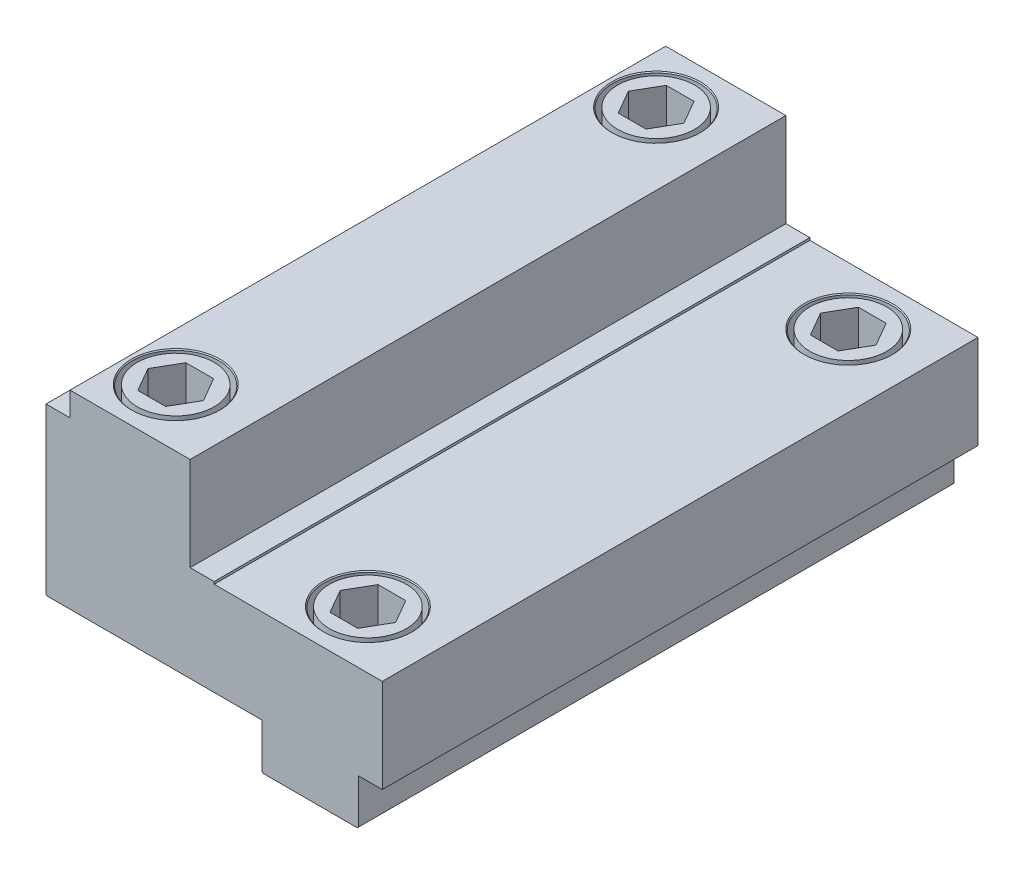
ISO-10303-21;
HEADER;
FILE_DESCRIPTION(('STEP AP214'),'2;1');
FILE_NAME('part.step','',(''),(''),'','','');
FILE_SCHEMA(('AUTOMOTIVE_DESIGN { 1 0 10303 214 1 1 1 1 }'));
ENDSEC;
DATA;
#1=APPLICATION_CONTEXT('core data for automotive mechanical design processes');
#2=APPLICATION_PROTOCOL_DEFINITION('international standard','automotive_design',2000,#1);
#3=PRODUCT_CONTEXT('',#1,'mechanical');
#4=PRODUCT('Part','Part','',(#3));
#5=PRODUCT_RELATED_PRODUCT_CATEGORY('part','',(#4));
#6=PRODUCT_DEFINITION_FORMATION('','',#4);
#7=PRODUCT_DEFINITION_CONTEXT('part definition',#1,'design');
#8=PRODUCT_DEFINITION('design','',#6,#7);
#9=PRODUCT_DEFINITION_SHAPE('','',#8);
#10=(LENGTH_UNIT() NAMED_UNIT(*) SI_UNIT(.MILLI.,.METRE.));
#11=(NAMED_UNIT(*) PLANE_ANGLE_UNIT() SI_UNIT($,.RADIAN.));
#12=(NAMED_UNIT(*) SI_UNIT($,.STERADIAN.) SOLID_ANGLE_UNIT());
#13=UNCERTAINTY_MEASURE_WITH_UNIT(LENGTH_MEASURE(1.E-05),#10,'distance_accuracy_value','');
#14=(GEOMETRIC_REPRESENTATION_CONTEXT(3) GLOBAL_UNCERTAINTY_ASSIGNED_CONTEXT((#13)) GLOBAL_UNIT_ASSIGNED_CONTEXT((#10,
#11,#12)) REPRESENTATION_CONTEXT('',''));
#15=CARTESIAN_POINT('',(0.,0.,0.));
#16=DIRECTION('',(0.,0.,1.));
#17=DIRECTION('',(1.,0.,0.));
#18=AXIS2_PLACEMENT_3D('',#15,#16,#17);
#19=CARTESIAN_POINT('',(55.,-9.5,-12.));
#20=DIRECTION('',(0.,1.,0.));
#21=DIRECTION('',(0.,0.,1.));
#22=AXIS2_PLACEMENT_3D('',#19,#20,#21);
#23=CYLINDRICAL_SURFACE('',#22,5.5);
#24=CARTESIAN_POINT('',(55.,-9.3,-12.));
#25=DIRECTION('',(0.,-1.,0.));
#26=DIRECTION('',(0.,0.,-1.));
#27=AXIS2_PLACEMENT_3D('',#24,#25,#26);
#28=CIRCLE('',#27,5.5);
#29=CARTESIAN_POINT('',(55.,-9.3,-6.5));
#30=VERTEX_POINT('',#29);
#31=EDGE_CURVE('E679',#30,#30,#28,.T.);
#32=CARTESIAN_POINT('',(55.,9.,-12.));
#33=DIRECTION('',(0.,1.,0.));
#34=DIRECTION('',(0.,0.,1.));
#35=AXIS2_PLACEMENT_3D('',#32,#33,#34);
#36=CIRCLE('',#35,5.5);
#37=CARTESIAN_POINT('',(55.,9.,-6.5));
#38=VERTEX_POINT('',#37);
#39=EDGE_CURVE('E12',#38,#38,#36,.F.);
#40=CARTESIAN_POINT('',(55.,-9.3,-6.5));
#41=CARTESIAN_POINT('',(55.,-9.109375,-6.5));
#42=CARTESIAN_POINT('',(55.,-8.91875,-6.5));
#43=CARTESIAN_POINT('',(55.,-8.5375,-6.5));
#44=CARTESIAN_POINT('',(55.,-8.346875,-6.5));
#45=CARTESIAN_POINT('',(55.,-7.965625,-6.5));
#46=CARTESIAN_POINT('',(55.,-7.775,-6.5));
#47=CARTESIAN_POINT('',(55.,-7.39375,-6.5));
#48=CARTESIAN_POINT('',(55.,-7.203125,-6.5));
#49=CARTESIAN_POINT('',(55.,-6.821875,-6.5));
#50=CARTESIAN_POINT('',(55.,-6.63125,-6.5));
#51=CARTESIAN_POINT('',(55.,-6.25,-6.5));
#52=CARTESIAN_POINT('',(55.,-6.059375,-6.5));
#53=CARTESIAN_POINT('',(55.,-5.678125,-6.5));
#54=CARTESIAN_POINT('',(55.,-5.4875,-6.5));
#55=CARTESIAN_POINT('',(55.,-5.10625,-6.5));
#56=CARTESIAN_POINT('',(55.,-4.915625,-6.5));
#57=CARTESIAN_POINT('',(55.,-4.534375,-6.5));
#58=CARTESIAN_POINT('',(55.,-4.34375,-6.5));
#59=CARTESIAN_POINT('',(55.,-3.9625,-6.5));
#60=CARTESIAN_POINT('',(55.,-3.771875,-6.5));
#61=CARTESIAN_POINT('',(55.,-3.390625,-6.5));
#62=CARTESIAN_POINT('',(55.,-3.2,-6.5));
#63=CARTESIAN_POINT('',(55.,-2.81875,-6.5));
#64=CARTESIAN_POINT('',(55.,-2.628125,-6.5));
#65=CARTESIAN_POINT('',(55.,-2.246875,-6.5));
#66=CARTESIAN_POINT('',(55.,-2.05625,-6.5));
#67=CARTESIAN_POINT('',(55.,-1.675,-6.5));
#68=CARTESIAN_POINT('',(55.,-1.484375,-6.5));
#69=CARTESIAN_POINT('',(55.,-1.103125,-6.5));
#70=CARTESIAN_POINT('',(55.,-0.912499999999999,-6.5));
#71=CARTESIAN_POINT('',(55.,-0.531249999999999,-6.5));
#72=CARTESIAN_POINT('',(55.,-0.340624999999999,-6.5));
#73=CARTESIAN_POINT('',(55.,0.0406250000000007,-6.5));
#74=CARTESIAN_POINT('',(55.,0.231250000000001,-6.5));
#75=CARTESIAN_POINT('',(55.,0.612500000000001,-6.5));
#76=CARTESIAN_POINT('',(55.,0.803125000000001,-6.5));
#77=CARTESIAN_POINT('',(55.,1.184375,-6.5));
#78=CARTESIAN_POINT('',(55.,1.375,-6.5));
#79=CARTESIAN_POINT('',(55.,1.75625,-6.5));
#80=CARTESIAN_POINT('',(55.,1.946875,-6.5));
#81=CARTESIAN_POINT('',(55.,2.328125,-6.5));
#82=CARTESIAN_POINT('',(55.,2.51875,-6.5));
#83=CARTESIAN_POINT('',(55.,2.9,-6.5));
#84=CARTESIAN_POINT('',(55.,3.090625,-6.5));
#85=CARTESIAN_POINT('',(55.,3.471875,-6.5));
#86=CARTESIAN_POINT('',(55.,3.6625,-6.5));
#87=CARTESIAN_POINT('',(55.,4.04375,-6.5));
#88=CARTESIAN_POINT('',(55.,4.234375,-6.5));
#89=CARTESIAN_POINT('',(55.,4.615625,-6.5));
#90=CARTESIAN_POINT('',(55.,4.80625,-6.5));
#91=CARTESIAN_POINT('',(55.,5.1875,-6.5));
#92=CARTESIAN_POINT('',(55.,5.378125,-6.5));
#93=CARTESIAN_POINT('',(55.,5.759375,-6.5));
#94=CARTESIAN_POINT('',(55.,5.95,-6.5));
#95=CARTESIAN_POINT('',(55.,6.33125,-6.5));
#96=CARTESIAN_POINT('',(55.,6.521875,-6.5));
#97=CARTESIAN_POINT('',(55.,6.903125,-6.5));
#98=CARTESIAN_POINT('',(55.,7.09375,-6.5));
#99=CARTESIAN_POINT('',(55.,7.475,-6.5));
#100=CARTESIAN_POINT('',(55.,7.665625,-6.5));
#101=CARTESIAN_POINT('',(55.,8.046875,-6.5));
#102=CARTESIAN_POINT('',(55.,8.2375,-6.5));
#103=CARTESIAN_POINT('',(55.,8.61875,-6.5));
#104=CARTESIAN_POINT('',(55.,8.809375,-6.5));
#105=CARTESIAN_POINT('',(55.,9.,-6.5));
#106=B_SPLINE_CURVE_WITH_KNOTS('',3,(#40,#41,#42,#43,#44,#45,#46,#47,#48,#49,#50,#51,#52,#53,
#54,#55,#56,#57,#58,#59,#60,#61,#62,#63,#64,#65,#66,#67,#68,#69,#70,#71,#72,#73,#74,#75,#76,#77,
#78,#79,#80,#81,#82,#83,#84,#85,#86,#87,#88,#89,#90,#91,#92,#93,#94,#95,#96,#97,#98,#99,#100,
#101,#102,#103,#104,#105),.UNSPECIFIED.,.F.,.F.,(4,2,2,2,2,2,2,2,2,2,2,2,2,2,2,2,2,2,2,2,2,2,2,
2,2,2,2,2,2,2,2,2,4),(0.,0.571874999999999,1.14375,1.715625,2.2875,2.859375,3.43125,4.003125,
4.575,5.146875,5.71875,6.290625,6.8625,7.434375,8.00625,8.578125,9.15,9.721875,10.29375,
10.865625,11.4375,12.009375,12.58125,13.153125,13.725,14.296875,14.86875,15.440625,16.0125,
16.584375,17.15625,17.728125,18.3),.UNSPECIFIED.);
#107=EDGE_CURVE('BSEAM83',#30,#38,#106,.T.);
#108=ORIENTED_EDGE('',*,*,#31,.T.);
#109=ORIENTED_EDGE('',*,*,#39,.F.);
#110=ORIENTED_EDGE('',*,*,#107,.T.);
#111=ORIENTED_EDGE('',*,*,#107,.F.);
#112=EDGE_LOOP('',(#108,#110,#109,#111));
#113=FACE_BOUND('',#112,.T.);
#114=ADVANCED_FACE('F83',(#113),#23,.F.);
#115=CARTESIAN_POINT('',(55.,-9.5,-112.));
#116=DIRECTION('',(0.,1.,0.));
#117=DIRECTION('',(0.,0.,1.));
#118=AXIS2_PLACEMENT_3D('',#115,#116,#117);
#119=CYLINDRICAL_SURFACE('',#118,5.5);
#120=CARTESIAN_POINT('',(55.,-9.30000000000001,-112.));
#121=DIRECTION('',(0.,-1.,0.));
#122=DIRECTION('',(0.,0.,-1.));
#123=AXIS2_PLACEMENT_3D('',#120,#121,#122);
#124=CIRCLE('',#123,5.5);
#125=CARTESIAN_POINT('',(55.,-9.3,-106.5));
#126=VERTEX_POINT('',#125);
#127=EDGE_CURVE('E676',#126,#126,#124,.T.);
#128=CARTESIAN_POINT('',(55.,9.,-112.));
#129=DIRECTION('',(0.,1.,0.));
#130=DIRECTION('',(0.,0.,1.));
#131=AXIS2_PLACEMENT_3D('',#128,#129,#130);
#132=CIRCLE('',#131,5.5);
#133=CARTESIAN_POINT('',(55.,9.,-106.5));
#134=VERTEX_POINT('',#133);
#135=EDGE_CURVE('E91',#134,#134,#132,.F.);
#136=CARTESIAN_POINT('',(55.,-9.3,-106.5));
#137=CARTESIAN_POINT('',(55.,-9.10937500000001,-106.5));
#138=CARTESIAN_POINT('',(55.,-8.91875,-106.5));
#139=CARTESIAN_POINT('',(55.,-8.5375,-106.5));
#140=CARTESIAN_POINT('',(55.,-8.34687500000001,-106.5));
#141=CARTESIAN_POINT('',(55.,-7.96562500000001,-106.5));
#142=CARTESIAN_POINT('',(55.,-7.775,-106.5));
#143=CARTESIAN_POINT('',(55.,-7.39375000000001,-106.5));
#144=CARTESIAN_POINT('',(55.,-7.203125,-106.5));
#145=CARTESIAN_POINT('',(55.,-6.821875,-106.5));
#146=CARTESIAN_POINT('',(55.,-6.63125,-106.5));
#147=CARTESIAN_POINT('',(55.,-6.25,-106.5));
#148=CARTESIAN_POINT('',(55.,-6.059375,-106.5));
#149=CARTESIAN_POINT('',(55.,-5.678125,-106.5));
#150=CARTESIAN_POINT('',(55.,-5.4875,-106.5));
#151=CARTESIAN_POINT('',(55.,-5.10625,-106.5));
#152=CARTESIAN_POINT('',(55.,-4.915625,-106.5));
#153=CARTESIAN_POINT('',(55.,-4.534375,-106.5));
#154=CARTESIAN_POINT('',(55.,-4.34375,-106.5));
#155=CARTESIAN_POINT('',(55.,-3.9625,-106.5));
#156=CARTESIAN_POINT('',(55.,-3.771875,-106.5));
#157=CARTESIAN_POINT('',(55.,-3.390625,-106.5));
#158=CARTESIAN_POINT('',(55.,-3.2,-106.5));
#159=CARTESIAN_POINT('',(55.,-2.81875,-106.5));
#160=CARTESIAN_POINT('',(55.,-2.628125,-106.5));
#161=CARTESIAN_POINT('',(55.,-2.246875,-106.5));
#162=CARTESIAN_POINT('',(55.,-2.05625,-106.5));
#163=CARTESIAN_POINT('',(55.,-1.675,-106.5));
#164=CARTESIAN_POINT('',(55.,-1.484375,-106.5));
#165=CARTESIAN_POINT('',(55.,-1.103125,-106.5));
#166=CARTESIAN_POINT('',(55.,-0.912500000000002,-106.5));
#167=CARTESIAN_POINT('',(55.,-0.531250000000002,-106.5));
#168=CARTESIAN_POINT('',(55.,-0.340625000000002,-106.5));
#169=CARTESIAN_POINT('',(55.,0.0406249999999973,-106.5));
#170=CARTESIAN_POINT('',(55.,0.231249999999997,-106.5));
#171=CARTESIAN_POINT('',(55.,0.612499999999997,-106.5));
#172=CARTESIAN_POINT('',(55.,0.803124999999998,-106.5));
#173=CARTESIAN_POINT('',(55.,1.184375,-106.5));
#174=CARTESIAN_POINT('',(55.,1.375,-106.5));
#175=CARTESIAN_POINT('',(55.,1.75625,-106.5));
#176=CARTESIAN_POINT('',(55.,1.946875,-106.5));
#177=CARTESIAN_POINT('',(55.,2.328125,-106.5));
#178=CARTESIAN_POINT('',(55.,2.51875,-106.5));
#179=CARTESIAN_POINT('',(55.,2.9,-106.5));
#180=CARTESIAN_POINT('',(55.,3.090625,-106.5));
#181=CARTESIAN_POINT('',(55.,3.471875,-106.5));
#182=CARTESIAN_POINT('',(55.,3.6625,-106.5));
#183=CARTESIAN_POINT('',(55.,4.04375,-106.5));
#184=CARTESIAN_POINT('',(55.,4.234375,-106.5));
#185=CARTESIAN_POINT('',(55.,4.615625,-106.5));
#186=CARTESIAN_POINT('',(55.,4.80625,-106.5));
#187=CARTESIAN_POINT('',(55.,5.1875,-106.5));
#188=CARTESIAN_POINT('',(55.,5.378125,-106.5));
#189=CARTESIAN_POINT('',(55.,5.759375,-106.5));
#190=CARTESIAN_POINT('',(55.,5.95,-106.5));
#191=CARTESIAN_POINT('',(55.,6.33125,-106.5));
#192=CARTESIAN_POINT('',(55.,6.521875,-106.5));
#193=CARTESIAN_POINT('',(55.,6.903125,-106.5));
#194=CARTESIAN_POINT('',(55.,7.09375,-106.5));
#195=CARTESIAN_POINT('',(55.,7.475,-106.5));
#196=CARTESIAN_POINT('',(55.,7.665625,-106.5));
#197=CARTESIAN_POINT('',(55.,8.046875,-106.5));
#198=CARTESIAN_POINT('',(55.,8.2375,-106.5));
#199=CARTESIAN_POINT('',(55.,8.61875,-106.5));
#200=CARTESIAN_POINT('',(55.,8.809375,-106.5));
#201=CARTESIAN_POINT('',(55.,9.,-106.5));
#202=B_SPLINE_CURVE_WITH_KNOTS('',3,(#136,#137,#138,#139,#140,#141,#142,#143,#144,#145,#146,
#147,#148,#149,#150,#151,#152,#153,#154,#155,#156,#157,#158,#159,#160,#161,#162,#163,#164,#165,
#166,#167,#168,#169,#170,#171,#172,#173,#174,#175,#176,#177,#178,#179,#180,#181,#182,#183,#184,
#185,#186,#187,#188,#189,#190,#191,#192,#193,#194,#195,#196,#197,#198,#199,#200,#201),
.UNSPECIFIED.,.F.,.F.,(4,2,2,2,2,2,2,2,2,2,2,2,2,2,2,2,2,2,2,2,2,2,2,2,2,2,2,2,2,2,2,2,4),(0.,
0.571874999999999,1.14375,1.715625,2.2875,2.859375,3.43125,4.003125,4.575,5.146875,5.71875,
6.290625,6.8625,7.434375,8.00625,8.578125,9.15,9.721875,10.29375,10.865625,11.4375,12.009375,
12.58125,13.153125,13.725,14.296875,14.86875,15.440625,16.0125,16.584375,17.15625,17.728125,
18.3),.UNSPECIFIED.);
#203=EDGE_CURVE('BSEAM746',#126,#134,#202,.T.);
#204=ORIENTED_EDGE('',*,*,#127,.T.);
#205=ORIENTED_EDGE('',*,*,#135,.F.);
#206=ORIENTED_EDGE('',*,*,#203,.T.);
#207=ORIENTED_EDGE('',*,*,#203,.F.);
#208=EDGE_LOOP('',(#204,#206,#205,#207));
#209=FACE_BOUND('',#208,.T.);
#210=ADVANCED_FACE('F746',(#209),#119,.F.);
#211=CARTESIAN_POINT('',(15.,-9.5,-12.));
#212=DIRECTION('',(0.,1.,0.));
#213=DIRECTION('',(0.,0.,1.));
#214=AXIS2_PLACEMENT_3D('',#211,#212,#213);
#215=CYLINDRICAL_SURFACE('',#214,5.5);
#216=CARTESIAN_POINT('',(15.,0.199999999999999,-12.));
#217=DIRECTION('',(0.,-1.,0.));
#218=DIRECTION('',(0.,0.,-1.));
#219=AXIS2_PLACEMENT_3D('',#216,#217,#218);
#220=CIRCLE('',#219,5.5);
#221=CARTESIAN_POINT('',(15.,0.200000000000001,-6.5));
#222=VERTEX_POINT('',#221);
#223=EDGE_CURVE('E682',#222,#222,#220,.T.);
#224=CARTESIAN_POINT('',(15.,28.5,-12.));
#225=DIRECTION('',(0.,1.,0.));
#226=DIRECTION('',(0.,0.,1.));
#227=AXIS2_PLACEMENT_3D('',#224,#225,#226);
#228=CIRCLE('',#227,5.5);
#229=CARTESIAN_POINT('',(15.,28.5,-6.5));
#230=VERTEX_POINT('',#229);
#231=EDGE_CURVE('E739',#230,#230,#228,.F.);
#232=CARTESIAN_POINT('',(15.,0.200000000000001,-6.5));
#233=CARTESIAN_POINT('',(15.,0.494791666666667,-6.5));
#234=CARTESIAN_POINT('',(15.,0.789583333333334,-6.5));
#235=CARTESIAN_POINT('',(15.,1.37916666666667,-6.5));
#236=CARTESIAN_POINT('',(15.,1.67395833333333,-6.5));
#237=CARTESIAN_POINT('',(15.,2.26354166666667,-6.5));
#238=CARTESIAN_POINT('',(15.,2.55833333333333,-6.5));
#239=CARTESIAN_POINT('',(15.,3.14791666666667,-6.5));
#240=CARTESIAN_POINT('',(15.,3.44270833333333,-6.5));
#241=CARTESIAN_POINT('',(15.,4.03229166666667,-6.5));
#242=CARTESIAN_POINT('',(15.,4.32708333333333,-6.5));
#243=CARTESIAN_POINT('',(15.,4.91666666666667,-6.5));
#244=CARTESIAN_POINT('',(15.,5.21145833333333,-6.5));
#245=CARTESIAN_POINT('',(15.,5.80104166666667,-6.5));
#246=CARTESIAN_POINT('',(15.,6.09583333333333,-6.5));
#247=CARTESIAN_POINT('',(15.,6.68541666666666,-6.5));
#248=CARTESIAN_POINT('',(15.,6.98020833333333,-6.5));
#249=CARTESIAN_POINT('',(15.,7.56979166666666,-6.5));
#250=CARTESIAN_POINT('',(15.,7.86458333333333,-6.5));
#251=CARTESIAN_POINT('',(15.,8.45416666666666,-6.5));
#252=CARTESIAN_POINT('',(15.,8.74895833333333,-6.5));
#253=CARTESIAN_POINT('',(15.,9.33854166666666,-6.5));
#254=CARTESIAN_POINT('',(15.,9.63333333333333,-6.5));
#255=CARTESIAN_POINT('',(15.,10.2229166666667,-6.5));
#256=CARTESIAN_POINT('',(15.,10.5177083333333,-6.5));
#257=CARTESIAN_POINT('',(15.,11.1072916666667,-6.5));
#258=CARTESIAN_POINT('',(15.,11.4020833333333,-6.5));
#259=CARTESIAN_POINT('',(15.,11.9916666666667,-6.5));
#260=CARTESIAN_POINT('',(15.,12.2864583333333,-6.5));
#261=CARTESIAN_POINT('',(15.,12.8760416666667,-6.5));
#262=CARTESIAN_POINT('',(15.,13.1708333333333,-6.5));
#263=CARTESIAN_POINT('',(15.,13.7604166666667,-6.5));
#264=CARTESIAN_POINT('',(15.,14.0552083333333,-6.5));
#265=CARTESIAN_POINT('',(15.,14.6447916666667,-6.5));
#266=CARTESIAN_POINT('',(15.,14.9395833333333,-6.5));
#267=CARTESIAN_POINT('',(15.,15.5291666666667,-6.5));
#268=CARTESIAN_POINT('',(15.,15.8239583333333,-6.5));
#269=CARTESIAN_POINT('',(15.,16.4135416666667,-6.5));
#270=CARTESIAN_POINT('',(15.,16.7083333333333,-6.5));
#271=CARTESIAN_POINT('',(15.,17.2979166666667,-6.5));
#272=CARTESIAN_POINT('',(15.,17.5927083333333,-6.5));
#273=CARTESIAN_POINT('',(15.,18.1822916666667,-6.5));
#274=CARTESIAN_POINT('',(15.,18.4770833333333,-6.5));
#275=CARTESIAN_POINT('',(15.,19.0666666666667,-6.5));
#276=CARTESIAN_POINT('',(15.,19.3614583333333,-6.5));
#277=CARTESIAN_POINT('',(15.,19.9510416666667,-6.5));
#278=CARTESIAN_POINT('',(15.,20.2458333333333,-6.5));
#279=CARTESIAN_POINT('',(15.,20.8354166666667,-6.5));
#280=CARTESIAN_POINT('',(15.,21.1302083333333,-6.5));
#281=CARTESIAN_POINT('',(15.,21.7197916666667,-6.5));
#282=CARTESIAN_POINT('',(15.,22.0145833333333,-6.5));
#283=CARTESIAN_POINT('',(15.,22.6041666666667,-6.5));
#284=CARTESIAN_POINT('',(15.,22.8989583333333,-6.5));
#285=CARTESIAN_POINT('',(15.,23.4885416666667,-6.5));
#286=CARTESIAN_POINT('',(15.,23.7833333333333,-6.5));
#287=CARTESIAN_POINT('',(15.,24.3729166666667,-6.5));
#288=CARTESIAN_POINT('',(15.,24.6677083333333,-6.5));
#289=CARTESIAN_POINT('',(15.,25.2572916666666,-6.5));
#290=CARTESIAN_POINT('',(15.,25.5520833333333,-6.5));
#291=CARTESIAN_POINT('',(15.,26.1416666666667,-6.5));
#292=CARTESIAN_POINT('',(15.,26.4364583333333,-6.5));
#293=CARTESIAN_POINT('',(15.,27.0260416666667,-6.5));
#294=CARTESIAN_POINT('',(15.,27.3208333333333,-6.5));
#295=CARTESIAN_POINT('',(15.,27.9104166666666,-6.5));
#296=CARTESIAN_POINT('',(15.,28.2052083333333,-6.5));
#297=CARTESIAN_POINT('',(15.,28.5,-6.5));
#298=B_SPLINE_CURVE_WITH_KNOTS('',3,(#232,#233,#234,#235,#236,#237,#238,#239,#240,#241,#242,
#243,#244,#245,#246,#247,#248,#249,#250,#251,#252,#253,#254,#255,#256,#257,#258,#259,#260,#261,
#262,#263,#264,#265,#266,#267,#268,#269,#270,#271,#272,#273,#274,#275,#276,#277,#278,#279,#280,
#281,#282,#283,#284,#285,#286,#287,#288,#289,#290,#291,#292,#293,#294,#295,#296,#297),
.UNSPECIFIED.,.F.,.F.,(4,2,2,2,2,2,2,2,2,2,2,2,2,2,2,2,2,2,2,2,2,2,2,2,2,2,2,2,2,2,2,2,4),(0.,
0.884375,1.76875,2.653125,3.5375,4.421875,5.30625,6.190625,7.075,7.95937499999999,
8.84374999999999,9.72812499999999,10.6125,11.496875,12.38125,13.265625,14.15,15.034375,15.91875,
16.803125,17.6875,18.571875,19.45625,20.340625,21.225,22.109375,22.99375,23.878125,24.7625,
25.646875,26.53125,27.415625,28.3),.UNSPECIFIED.);
#299=EDGE_CURVE('BSEAM748',#222,#230,#298,.T.);
#300=ORIENTED_EDGE('',*,*,#223,.T.);
#301=ORIENTED_EDGE('',*,*,#231,.F.);
#302=ORIENTED_EDGE('',*,*,#299,.T.);
#303=ORIENTED_EDGE('',*,*,#299,.F.);
#304=EDGE_LOOP('',(#300,#302,#301,#303));
#305=FACE_BOUND('',#304,.T.);
#306=ADVANCED_FACE('F748',(#305),#215,.F.);
#307=CARTESIAN_POINT('',(15.,-9.5,-112.));
#308=DIRECTION('',(0.,1.,0.));
#309=DIRECTION('',(0.,0.,1.));
#310=AXIS2_PLACEMENT_3D('',#307,#308,#309);
#311=CYLINDRICAL_SURFACE('',#310,5.5);
#312=CARTESIAN_POINT('',(15.,0.199999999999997,-112.));
#313=DIRECTION('',(0.,-1.,0.));
#314=DIRECTION('',(0.,0.,-1.));
#315=AXIS2_PLACEMENT_3D('',#312,#313,#314);
#316=CIRCLE('',#315,5.5);
#317=CARTESIAN_POINT('',(15.,0.199999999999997,-106.5));
#318=VERTEX_POINT('',#317);
#319=EDGE_CURVE('E673',#318,#318,#316,.T.);
#320=CARTESIAN_POINT('',(15.,28.5,-112.));
#321=DIRECTION('',(0.,1.,0.));
#322=DIRECTION('',(0.,0.,1.));
#323=AXIS2_PLACEMENT_3D('',#320,#321,#322);
#324=CIRCLE('',#323,5.5);
#325=CARTESIAN_POINT('',(15.,28.5,-106.5));
#326=VERTEX_POINT('',#325);
#327=EDGE_CURVE('E736',#326,#326,#324,.F.);
#328=CARTESIAN_POINT('',(15.,0.199999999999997,-106.5));
#329=CARTESIAN_POINT('',(15.,0.494791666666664,-106.5));
#330=CARTESIAN_POINT('',(15.,0.78958333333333,-106.5));
#331=CARTESIAN_POINT('',(15.,1.37916666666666,-106.5));
#332=CARTESIAN_POINT('',(15.,1.67395833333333,-106.5));
#333=CARTESIAN_POINT('',(15.,2.26354166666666,-106.5));
#334=CARTESIAN_POINT('',(15.,2.55833333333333,-106.5));
#335=CARTESIAN_POINT('',(15.,3.14791666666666,-106.5));
#336=CARTESIAN_POINT('',(15.,3.44270833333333,-106.5));
#337=CARTESIAN_POINT('',(15.,4.03229166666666,-106.5));
#338=CARTESIAN_POINT('',(15.,4.32708333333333,-106.5));
#339=CARTESIAN_POINT('',(15.,4.91666666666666,-106.5));
#340=CARTESIAN_POINT('',(15.,5.21145833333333,-106.5));
#341=CARTESIAN_POINT('',(15.,5.80104166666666,-106.5));
#342=CARTESIAN_POINT('',(15.,6.09583333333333,-106.5));
#343=CARTESIAN_POINT('',(15.,6.68541666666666,-106.5));
#344=CARTESIAN_POINT('',(15.,6.98020833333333,-106.5));
#345=CARTESIAN_POINT('',(15.,7.56979166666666,-106.5));
#346=CARTESIAN_POINT('',(15.,7.86458333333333,-106.5));
#347=CARTESIAN_POINT('',(15.,8.45416666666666,-106.5));
#348=CARTESIAN_POINT('',(15.,8.74895833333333,-106.5));
#349=CARTESIAN_POINT('',(15.,9.33854166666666,-106.5));
#350=CARTESIAN_POINT('',(15.,9.63333333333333,-106.5));
#351=CARTESIAN_POINT('',(15.,10.2229166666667,-106.5));
#352=CARTESIAN_POINT('',(15.,10.5177083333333,-106.5));
#353=CARTESIAN_POINT('',(15.,11.1072916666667,-106.5));
#354=CARTESIAN_POINT('',(15.,11.4020833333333,-106.5));
#355=CARTESIAN_POINT('',(15.,11.9916666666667,-106.5));
#356=CARTESIAN_POINT('',(15.,12.2864583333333,-106.5));
#357=CARTESIAN_POINT('',(15.,12.8760416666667,-106.5));
#358=CARTESIAN_POINT('',(15.,13.1708333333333,-106.5));
#359=CARTESIAN_POINT('',(15.,13.7604166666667,-106.5));
#360=CARTESIAN_POINT('',(15.,14.0552083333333,-106.5));
#361=CARTESIAN_POINT('',(15.,14.6447916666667,-106.5));
#362=CARTESIAN_POINT('',(15.,14.9395833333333,-106.5));
#363=CARTESIAN_POINT('',(15.,15.5291666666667,-106.5));
#364=CARTESIAN_POINT('',(15.,15.8239583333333,-106.5));
#365=CARTESIAN_POINT('',(15.,16.4135416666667,-106.5));
#366=CARTESIAN_POINT('',(15.,16.7083333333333,-106.5));
#367=CARTESIAN_POINT('',(15.,17.2979166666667,-106.5));
#368=CARTESIAN_POINT('',(15.,17.5927083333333,-106.5));
#369=CARTESIAN_POINT('',(15.,18.1822916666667,-106.5));
#370=CARTESIAN_POINT('',(15.,18.4770833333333,-106.5));
#371=CARTESIAN_POINT('',(15.,19.0666666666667,-106.5));
#372=CARTESIAN_POINT('',(15.,19.3614583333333,-106.5));
#373=CARTESIAN_POINT('',(15.,19.9510416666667,-106.5));
#374=CARTESIAN_POINT('',(15.,20.2458333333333,-106.5));
#375=CARTESIAN_POINT('',(15.,20.8354166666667,-106.5));
#376=CARTESIAN_POINT('',(15.,21.1302083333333,-106.5));
#377=CARTESIAN_POINT('',(15.,21.7197916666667,-106.5));
#378=CARTESIAN_POINT('',(15.,22.0145833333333,-106.5));
#379=CARTESIAN_POINT('',(15.,22.6041666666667,-106.5));
#380=CARTESIAN_POINT('',(15.,22.8989583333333,-106.5));
#381=CARTESIAN_POINT('',(15.,23.4885416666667,-106.5));
#382=CARTESIAN_POINT('',(15.,23.7833333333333,-106.5));
#383=CARTESIAN_POINT('',(15.,24.3729166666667,-106.5));
#384=CARTESIAN_POINT('',(15.,24.6677083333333,-106.5));
#385=CARTESIAN_POINT('',(15.,25.2572916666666,-106.5));
#386=CARTESIAN_POINT('',(15.,25.5520833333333,-106.5));
#387=CARTESIAN_POINT('',(15.,26.1416666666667,-106.5));
#388=CARTESIAN_POINT('',(15.,26.4364583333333,-106.5));
#389=CARTESIAN_POINT('',(15.,27.0260416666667,-106.5));
#390=CARTESIAN_POINT('',(15.,27.3208333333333,-106.5));
#391=CARTESIAN_POINT('',(15.,27.9104166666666,-106.5));
#392=CARTESIAN_POINT('',(15.,28.2052083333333,-106.5));
#393=CARTESIAN_POINT('',(15.,28.5,-106.5));
#394=B_SPLINE_CURVE_WITH_KNOTS('',3,(#328,#329,#330,#331,#332,#333,#334,#335,#336,#337,#338,
#339,#340,#341,#342,#343,#344,#345,#346,#347,#348,#349,#350,#351,#352,#353,#354,#355,#356,#357,
#358,#359,#360,#361,#362,#363,#364,#365,#366,#367,#368,#369,#370,#371,#372,#373,#374,#375,#376,
#377,#378,#379,#380,#381,#382,#383,#384,#385,#386,#387,#388,#389,#390,#391,#392,#393),
.UNSPECIFIED.,.F.,.F.,(4,2,2,2,2,2,2,2,2,2,2,2,2,2,2,2,2,2,2,2,2,2,2,2,2,2,2,2,2,2,2,2,4),(0.,
0.884375,1.76875,2.653125,3.5375,4.421875,5.30625,6.190625,7.075,7.959375,8.84375,9.728125,
10.6125,11.496875,12.38125,13.265625,14.15,15.034375,15.91875,16.803125,17.6875,18.571875,
19.45625,20.340625,21.225,22.109375,22.99375,23.878125,24.7625,25.646875,26.53125,27.415625,
28.3),.UNSPECIFIED.);
#395=EDGE_CURVE('BSEAM755',#318,#326,#394,.T.);
#396=ORIENTED_EDGE('',*,*,#319,.T.);
#397=ORIENTED_EDGE('',*,*,#327,.F.);
#398=ORIENTED_EDGE('',*,*,#395,.T.);
#399=ORIENTED_EDGE('',*,*,#395,.F.);
#400=EDGE_LOOP('',(#396,#398,#397,#399));
#401=FACE_BOUND('',#400,.T.);
#402=ADVANCED_FACE('F755',(#401),#311,.F.);
#403=CARTESIAN_POINT('',(55.,10.,-12.));
#404=DIRECTION('',(0.,1.,0.));
#405=DIRECTION('',(0.,0.,1.));
#406=AXIS2_PLACEMENT_3D('',#403,#404,#405);
#407=PLANE('',#406);
#408=CARTESIAN_POINT('',(55.,10.,-12.));
#409=DIRECTION('',(0.,1.,0.));
#410=DIRECTION('',(0.,0.,1.));
#411=AXIS2_PLACEMENT_3D('',#408,#409,#410);
#412=CIRCLE('',#411,9.);
#413=CARTESIAN_POINT('',(55.,10.,-3.));
#414=VERTEX_POINT('',#413);
#415=EDGE_CURVE('E570',#414,#414,#412,.T.);
#416=ORIENTED_EDGE('',*,*,#415,.T.);
#417=EDGE_LOOP('',(#416));
#418=FACE_BOUND('',#417,.T.);
#419=CARTESIAN_POINT('',(55.,10.,-12.));
#420=DIRECTION('',(0.,1.,0.));
#421=DIRECTION('',(0.,0.,1.));
#422=AXIS2_PLACEMENT_3D('',#419,#420,#421);
#423=CIRCLE('',#422,8.00000000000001);
#424=CARTESIAN_POINT('',(55.,10.,-3.99999999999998));
#425=VERTEX_POINT('',#424);
#426=EDGE_CURVE('E357',#425,#425,#423,.T.);
#427=ORIENTED_EDGE('',*,*,#426,.F.);
#428=EDGE_LOOP('',(#427));
#429=FACE_BOUND('',#428,.T.);
#430=ADVANCED_FACE('F948',(#418,#429),#407,.T.);
#431=CARTESIAN_POINT('',(55.,10.,-112.));
#432=DIRECTION('',(0.,1.,0.));
#433=DIRECTION('',(0.,0.,1.));
#434=AXIS2_PLACEMENT_3D('',#431,#432,#433);
#435=PLANE('',#434);
#436=CARTESIAN_POINT('',(55.,10.,-112.));
#437=DIRECTION('',(0.,1.,0.));
#438=DIRECTION('',(0.,0.,1.));
#439=AXIS2_PLACEMENT_3D('',#436,#437,#438);
#440=CIRCLE('',#439,8.99999999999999);
#441=CARTESIAN_POINT('',(55.,10.,-103.));
#442=VERTEX_POINT('',#441);
#443=EDGE_CURVE('E573',#442,#442,#440,.T.);
#444=ORIENTED_EDGE('',*,*,#443,.T.);
#445=EDGE_LOOP('',(#444));
#446=FACE_BOUND('',#445,.T.);
#447=CARTESIAN_POINT('',(55.,10.,-112.));
#448=DIRECTION('',(0.,1.,0.));
#449=DIRECTION('',(0.,0.,1.));
#450=AXIS2_PLACEMENT_3D('',#447,#448,#449);
#451=CIRCLE('',#450,8.00000000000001);
#452=CARTESIAN_POINT('',(55.,10.,-104.));
#453=VERTEX_POINT('',#452);
#454=EDGE_CURVE('E436',#453,#453,#451,.T.);
#455=ORIENTED_EDGE('',*,*,#454,.F.);
#456=EDGE_LOOP('',(#455));
#457=FACE_BOUND('',#456,.T.);
#458=ADVANCED_FACE('F955',(#446,#457),#435,.T.);
#459=CARTESIAN_POINT('',(15.,29.5,-12.));
#460=DIRECTION('',(0.,1.,0.));
#461=DIRECTION('',(0.,0.,1.));
#462=AXIS2_PLACEMENT_3D('',#459,#460,#461);
#463=PLANE('',#462);
#464=CARTESIAN_POINT('',(15.,29.5,-12.));
#465=DIRECTION('',(0.,1.,0.));
#466=DIRECTION('',(0.,0.,1.));
#467=AXIS2_PLACEMENT_3D('',#464,#465,#466);
#468=CIRCLE('',#467,9.);
#469=CARTESIAN_POINT('',(15.,29.5,-3.));
#470=VERTEX_POINT('',#469);
#471=EDGE_CURVE('E563',#470,#470,#468,.T.);
#472=ORIENTED_EDGE('',*,*,#471,.T.);
#473=EDGE_LOOP('',(#472));
#474=FACE_BOUND('',#473,.T.);
#475=CARTESIAN_POINT('',(15.,29.5,-12.));
#476=DIRECTION('',(0.,1.,0.));
#477=DIRECTION('',(0.,0.,1.));
#478=AXIS2_PLACEMENT_3D('',#475,#476,#477);
#479=CIRCLE('',#478,8.00000000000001);
#480=CARTESIAN_POINT('',(15.,29.5,-3.99999999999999));
#481=VERTEX_POINT('',#480);
#482=EDGE_CURVE('E444',#481,#481,#479,.T.);
#483=ORIENTED_EDGE('',*,*,#482,.F.);
#484=EDGE_LOOP('',(#483));
#485=FACE_BOUND('',#484,.T.);
#486=ADVANCED_FACE('F934',(#474,#485),#463,.T.);
#487=CARTESIAN_POINT('',(15.,29.5,-112.));
#488=DIRECTION('',(0.,1.,0.));
#489=DIRECTION('',(0.,0.,1.));
#490=AXIS2_PLACEMENT_3D('',#487,#488,#489);
#491=PLANE('',#490);
#492=CARTESIAN_POINT('',(15.,29.5,-112.));
#493=DIRECTION('',(0.,1.,0.));
#494=DIRECTION('',(0.,0.,1.));
#495=AXIS2_PLACEMENT_3D('',#492,#493,#494);
#496=CIRCLE('',#495,9.00000000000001);
#497=CARTESIAN_POINT('',(15.,29.5,-103.));
#498=VERTEX_POINT('',#497);
#499=EDGE_CURVE('E567',#498,#498,#496,.T.);
#500=ORIENTED_EDGE('',*,*,#499,.T.);
#501=EDGE_LOOP('',(#500));
#502=FACE_BOUND('',#501,.T.);
#503=CARTESIAN_POINT('',(15.,29.5,-112.));
#504=DIRECTION('',(0.,1.,0.));
#505=DIRECTION('',(0.,0.,1.));
#506=AXIS2_PLACEMENT_3D('',#503,#504,#505);
#507=CIRCLE('',#506,8.00000000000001);
#508=CARTESIAN_POINT('',(15.,29.5,-104.));
#509=VERTEX_POINT('',#508);
#510=EDGE_CURVE('E544',#509,#509,#507,.T.);
#511=ORIENTED_EDGE('',*,*,#510,.F.);
#512=EDGE_LOOP('',(#511));
#513=FACE_BOUND('',#512,.T.);
#514=ADVANCED_FACE('F802',(#502,#513),#491,.T.);
#515=CARTESIAN_POINT('',(70.,20.,-124.));
#516=DIRECTION('',(1.,0.,0.));
#517=DIRECTION('',(0.,0.,-1.));
#518=AXIS2_PLACEMENT_3D('',#515,#516,#517);
#519=PLANE('',#518);
#520=DIRECTION('',(0.,1.,0.));
#521=VECTOR('',#520,1.);
#522=CARTESIAN_POINT('',(70.,20.,-124.));
#523=LINE('',#522,#521);
#524=CARTESIAN_POINT('',(70.,0.,-124.));
#525=VERTEX_POINT('',#524);
#526=CARTESIAN_POINT('',(70.,19.5,-124.));
#527=VERTEX_POINT('',#526);
#528=EDGE_CURVE('E591',#525,#527,#523,.T.);
#529=ORIENTED_EDGE('',*,*,#528,.T.);
#530=DIRECTION('',(0.,0.,-1.));
#531=VECTOR('',#530,1.);
#532=CARTESIAN_POINT('',(70.,19.5,0.));
#533=LINE('',#532,#531);
#534=CARTESIAN_POINT('',(70.,19.5,0.));
#535=VERTEX_POINT('',#534);
#536=EDGE_CURVE('E549',#535,#527,#533,.T.);
#537=ORIENTED_EDGE('',*,*,#536,.F.);
#538=DIRECTION('',(0.,1.,0.));
#539=VECTOR('',#538,1.);
#540=CARTESIAN_POINT('',(70.,20.,0.));
#541=LINE('',#540,#539);
#542=CARTESIAN_POINT('',(70.,0.,0.));
#543=VERTEX_POINT('',#542);
#544=EDGE_CURVE('E624',#543,#535,#541,.T.);
#545=ORIENTED_EDGE('',*,*,#544,.F.);
#546=DIRECTION('',(0.,0.,1.));
#547=VECTOR('',#546,1.);
#548=CARTESIAN_POINT('',(70.,0.,-124.));
#549=LINE('',#548,#547);
#550=EDGE_CURVE('E655',#525,#543,#549,.T.);
#551=ORIENTED_EDGE('',*,*,#550,.F.);
#552=EDGE_LOOP('',(#529,#537,#545,#551));
#553=FACE_BOUND('',#552,.T.);
#554=ADVANCED_FACE('F798',(#553),#519,.T.);
#555=CARTESIAN_POINT('',(55.,10.,-112.));
#556=DIRECTION('',(0.,1.,0.));
#557=DIRECTION('',(0.,0.,1.));
#558=AXIS2_PLACEMENT_3D('',#555,#556,#557);
#559=CYLINDRICAL_SURFACE('',#558,8.99999999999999);
#560=CARTESIAN_POINT('',(55.,19.3,-112.));
#561=DIRECTION('',(0.,1.,0.));
#562=DIRECTION('',(0.,0.,1.));
#563=AXIS2_PLACEMENT_3D('',#560,#561,#562);
#564=CIRCLE('',#563,8.99999999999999);
#565=CARTESIAN_POINT('',(55.,19.3,-103.));
#566=VERTEX_POINT('',#565);
#567=EDGE_CURVE('E730',#566,#566,#564,.T.);
#568=ORIENTED_EDGE('',*,*,#567,.T.);
#569=EDGE_LOOP('',(#568));
#570=FACE_BOUND('',#569,.T.);
#571=ORIENTED_EDGE('',*,*,#443,.F.);
#572=EDGE_LOOP('',(#571));
#573=FACE_BOUND('',#572,.T.);
#574=ADVANCED_FACE('F801',(#570,#573),#559,.F.);
#575=CARTESIAN_POINT('',(55.,10.,-12.));
#576=DIRECTION('',(0.,1.,0.));
#577=DIRECTION('',(0.,0.,1.));
#578=AXIS2_PLACEMENT_3D('',#575,#576,#577);
#579=CYLINDRICAL_SURFACE('',#578,9.);
#580=CARTESIAN_POINT('',(55.,19.3,-12.));
#581=DIRECTION('',(0.,1.,0.));
#582=DIRECTION('',(0.,0.,1.));
#583=AXIS2_PLACEMENT_3D('',#580,#581,#582);
#584=CIRCLE('',#583,9.);
#585=CARTESIAN_POINT('',(55.,19.3,-3.));
#586=VERTEX_POINT('',#585);
#587=EDGE_CURVE('E733',#586,#586,#584,.T.);
#588=ORIENTED_EDGE('',*,*,#587,.T.);
#589=EDGE_LOOP('',(#588));
#590=FACE_BOUND('',#589,.T.);
#591=ORIENTED_EDGE('',*,*,#415,.F.);
#592=EDGE_LOOP('',(#591));
#593=FACE_BOUND('',#592,.T.);
#594=ADVANCED_FACE('F820',(#590,#593),#579,.F.);
#595=CARTESIAN_POINT('',(45.,0.,-124.));
#596=DIRECTION('',(0.,-1.,0.));
#597=DIRECTION('',(1.,0.,0.));
#598=AXIS2_PLACEMENT_3D('',#595,#596,#597);
#599=PLANE('',#598);
#600=CARTESIAN_POINT('',(15.,0.,-12.));
#601=DIRECTION('',(0.,-1.,0.));
#602=DIRECTION('',(1.,0.,0.));
#603=AXIS2_PLACEMENT_3D('',#600,#601,#602);
#604=CIRCLE('',#603,5.7);
#605=CARTESIAN_POINT('',(20.7,0.,-12.));
#606=VERTEX_POINT('',#605);
#607=EDGE_CURVE('E690',#606,#606,#604,.F.);
#608=ORIENTED_EDGE('',*,*,#607,.T.);
#609=EDGE_LOOP('',(#608));
#610=FACE_BOUND('',#609,.T.);
#611=CARTESIAN_POINT('',(15.,0.,-112.));
#612=DIRECTION('',(0.,-1.,0.));
#613=DIRECTION('',(1.,0.,0.));
#614=AXIS2_PLACEMENT_3D('',#611,#612,#613);
#615=CIRCLE('',#614,5.7);
#616=CARTESIAN_POINT('',(20.7,0.,-112.));
#617=VERTEX_POINT('',#616);
#618=EDGE_CURVE('E687',#617,#617,#615,.F.);
#619=ORIENTED_EDGE('',*,*,#618,.T.);
#620=EDGE_LOOP('',(#619));
#621=FACE_BOUND('',#620,.T.);
#622=DIRECTION('',(1.,0.,0.));
#623=VECTOR('',#622,1.);
#624=CARTESIAN_POINT('',(45.,0.,0.));
#625=LINE('',#624,#623);
#626=CARTESIAN_POINT('',(0.199999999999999,0.,0.));
#627=VERTEX_POINT('',#626);
#628=CARTESIAN_POINT('',(45.,0.,0.));
#629=VERTEX_POINT('',#628);
#630=EDGE_CURVE('E576',#627,#629,#625,.T.);
#631=ORIENTED_EDGE('',*,*,#630,.F.);
#632=DIRECTION('',(0.,0.,-1.));
#633=VECTOR('',#632,1.);
#634=CARTESIAN_POINT('',(0.199999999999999,0.,-124.));
#635=LINE('',#634,#633);
#636=CARTESIAN_POINT('',(0.20000000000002,0.,-124.));
#637=VERTEX_POINT('',#636);
#638=EDGE_CURVE('E685',#627,#637,#635,.T.);
#639=ORIENTED_EDGE('',*,*,#638,.T.);
#640=DIRECTION('',(1.,0.,0.));
#641=VECTOR('',#640,1.);
#642=CARTESIAN_POINT('',(45.,0.,-124.));
#643=LINE('',#642,#641);
#644=CARTESIAN_POINT('',(45.,0.,-124.));
#645=VERTEX_POINT('',#644);
#646=EDGE_CURVE('E577',#637,#645,#643,.T.);
#647=ORIENTED_EDGE('',*,*,#646,.T.);
#648=DIRECTION('',(0.,0.,1.));
#649=VECTOR('',#648,1.);
#650=CARTESIAN_POINT('',(45.,0.,-124.));
#651=LINE('',#650,#649);
#652=EDGE_CURVE('E611',#645,#629,#651,.T.);
#653=ORIENTED_EDGE('',*,*,#652,.T.);
#654=EDGE_LOOP('',(#631,#639,#647,#653));
#655=FACE_BOUND('',#654,.T.);
#656=ADVANCED_FACE('F776',(#610,#621,#655),#599,.T.);
#657=CARTESIAN_POINT('',(0.,0.,-124.));
#658=DIRECTION('',(-1.,0.,0.));
#659=DIRECTION('',(0.,0.,1.));
#660=AXIS2_PLACEMENT_3D('',#657,#658,#659);
#661=PLANE('',#660);
#662=DIRECTION('',(0.,-1.,0.));
#663=VECTOR('',#662,1.);
#664=CARTESIAN_POINT('',(0.,0.,-124.));
#665=LINE('',#664,#663);
#666=CARTESIAN_POINT('',(0.,34.5,-124.));
#667=VERTEX_POINT('',#666);
#668=CARTESIAN_POINT('',(0.,0.2,-124.));
#669=VERTEX_POINT('',#668);
#670=EDGE_CURVE('E608',#667,#669,#665,.T.);
#671=ORIENTED_EDGE('',*,*,#670,.T.);
#672=DIRECTION('',(0.,0.,1.));
#673=VECTOR('',#672,1.);
#674=CARTESIAN_POINT('',(0.,0.2,-124.));
#675=LINE('',#674,#673);
#676=CARTESIAN_POINT('',(0.,0.2,0.));
#677=VERTEX_POINT('',#676);
#678=EDGE_CURVE('E721',#669,#677,#675,.T.);
#679=ORIENTED_EDGE('',*,*,#678,.T.);
#680=DIRECTION('',(0.,-1.,0.));
#681=VECTOR('',#680,1.);
#682=CARTESIAN_POINT('',(0.,0.,0.));
#683=LINE('',#682,#681);
#684=CARTESIAN_POINT('',(0.,34.5,0.));
#685=VERTEX_POINT('',#684);
#686=EDGE_CURVE('E580',#685,#677,#683,.T.);
#687=ORIENTED_EDGE('',*,*,#686,.F.);
#688=DIRECTION('',(0.,0.,1.));
#689=VECTOR('',#688,1.);
#690=CARTESIAN_POINT('',(0.,34.5,-124.));
#691=LINE('',#690,#689);
#692=EDGE_CURVE('E643',#667,#685,#691,.T.);
#693=ORIENTED_EDGE('',*,*,#692,.F.);
#694=EDGE_LOOP('',(#671,#679,#687,#693));
#695=FACE_BOUND('',#694,.T.);
#696=ADVANCED_FACE('F772',(#695),#661,.T.);
#697=CARTESIAN_POINT('',(0.,34.5,-124.));
#698=DIRECTION('',(0.,1.,0.));
#699=DIRECTION('',(0.,0.,1.));
#700=AXIS2_PLACEMENT_3D('',#697,#698,#699);
#701=PLANE('',#700);
#702=DIRECTION('',(-1.,0.,0.));
#703=VECTOR('',#702,1.);
#704=CARTESIAN_POINT('',(0.,34.5,0.));
#705=LINE('',#704,#703);
#706=CARTESIAN_POINT('',(5.,34.5,0.));
#707=VERTEX_POINT('',#706);
#708=EDGE_CURVE('E638',#707,#685,#705,.T.);
#709=ORIENTED_EDGE('',*,*,#708,.F.);
#710=DIRECTION('',(0.,0.,1.));
#711=VECTOR('',#710,1.);
#712=CARTESIAN_POINT('',(5.,34.5,-124.));
#713=LINE('',#712,#711);
#714=CARTESIAN_POINT('',(5.,34.5,-124.));
#715=VERTEX_POINT('',#714);
#716=EDGE_CURVE('E646',#715,#707,#713,.T.);
#717=ORIENTED_EDGE('',*,*,#716,.F.);
#718=DIRECTION('',(-1.,0.,0.));
#719=VECTOR('',#718,1.);
#720=CARTESIAN_POINT('',(0.,34.5,-124.));
#721=LINE('',#720,#719);
#722=EDGE_CURVE('E605',#715,#667,#721,.T.);
#723=ORIENTED_EDGE('',*,*,#722,.T.);
#724=ORIENTED_EDGE('',*,*,#692,.T.);
#725=EDGE_LOOP('',(#709,#717,#723,#724));
#726=FACE_BOUND('',#725,.T.);
#727=ADVANCED_FACE('F775',(#726),#701,.T.);
#728=CARTESIAN_POINT('',(5.,34.5,-124.));
#729=DIRECTION('',(-1.,0.,0.));
#730=DIRECTION('',(0.,0.,1.));
#731=AXIS2_PLACEMENT_3D('',#728,#729,#730);
#732=PLANE('',#731);
#733=DIRECTION('',(0.,-1.,0.));
#734=VECTOR('',#733,1.);
#735=CARTESIAN_POINT('',(5.,34.5,0.));
#736=LINE('',#735,#734);
#737=CARTESIAN_POINT('',(5.,39.5,0.));
#738=VERTEX_POINT('',#737);
#739=EDGE_CURVE('E635',#738,#707,#736,.T.);
#740=ORIENTED_EDGE('',*,*,#739,.F.);
#741=DIRECTION('',(0.,0.,1.));
#742=VECTOR('',#741,1.);
#743=CARTESIAN_POINT('',(5.,39.5,-124.));
#744=LINE('',#743,#742);
#745=CARTESIAN_POINT('',(5.,39.5,-124.));
#746=VERTEX_POINT('',#745);
#747=EDGE_CURVE('E648',#746,#738,#744,.T.);
#748=ORIENTED_EDGE('',*,*,#747,.F.);
#749=DIRECTION('',(0.,-1.,0.));
#750=VECTOR('',#749,1.);
#751=CARTESIAN_POINT('',(5.,34.5,-124.));
#752=LINE('',#751,#750);
#753=EDGE_CURVE('E602',#746,#715,#752,.T.);
#754=ORIENTED_EDGE('',*,*,#753,.T.);
#755=ORIENTED_EDGE('',*,*,#716,.T.);
#756=EDGE_LOOP('',(#740,#748,#754,#755));
#757=FACE_BOUND('',#756,.T.);
#758=ADVANCED_FACE('F780',(#757),#732,.T.);
#759=CARTESIAN_POINT('',(5.,39.5,-124.));
#760=DIRECTION('',(0.,1.,0.));
#761=DIRECTION('',(-1.,0.,0.));
#762=AXIS2_PLACEMENT_3D('',#759,#760,#761);
#763=PLANE('',#762);
#764=CARTESIAN_POINT('',(15.,39.5,-112.));
#765=DIRECTION('',(0.,1.,0.));
#766=DIRECTION('',(-1.,0.,0.));
#767=AXIS2_PLACEMENT_3D('',#764,#765,#766);
#768=CIRCLE('',#767,9.20000000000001);
#769=CARTESIAN_POINT('',(5.79999999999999,39.5,-112.));
#770=VERTEX_POINT('',#769);
#771=EDGE_CURVE('E667',#770,#770,#768,.F.);
#772=ORIENTED_EDGE('',*,*,#771,.T.);
#773=EDGE_LOOP('',(#772));
#774=FACE_BOUND('',#773,.T.);
#775=CARTESIAN_POINT('',(15.,39.5,-12.));
#776=DIRECTION('',(0.,1.,0.));
#777=DIRECTION('',(-1.,0.,0.));
#778=AXIS2_PLACEMENT_3D('',#775,#776,#777);
#779=CIRCLE('',#778,9.2);
#780=CARTESIAN_POINT('',(5.8,39.5,-12.));
#781=VERTEX_POINT('',#780);
#782=EDGE_CURVE('E664',#781,#781,#779,.F.);
#783=ORIENTED_EDGE('',*,*,#782,.T.);
#784=EDGE_LOOP('',(#783));
#785=FACE_BOUND('',#784,.T.);
#786=DIRECTION('',(-1.,0.,0.));
#787=VECTOR('',#786,1.);
#788=CARTESIAN_POINT('',(5.,39.5,0.));
#789=LINE('',#788,#787);
#790=CARTESIAN_POINT('',(30.,39.5,0.));
#791=VERTEX_POINT('',#790);
#792=EDGE_CURVE('E632',#791,#738,#789,.T.);
#793=ORIENTED_EDGE('',*,*,#792,.F.);
#794=DIRECTION('',(0.,0.,1.));
#795=VECTOR('',#794,1.);
#796=CARTESIAN_POINT('',(30.,39.5,-124.));
#797=LINE('',#796,#795);
#798=CARTESIAN_POINT('',(30.,39.5,-124.));
#799=VERTEX_POINT('',#798);
#800=EDGE_CURVE('E650',#799,#791,#797,.T.);
#801=ORIENTED_EDGE('',*,*,#800,.F.);
#802=DIRECTION('',(-1.,0.,0.));
#803=VECTOR('',#802,1.);
#804=CARTESIAN_POINT('',(5.,39.5,-124.));
#805=LINE('',#804,#803);
#806=EDGE_CURVE('E599',#799,#746,#805,.T.);
#807=ORIENTED_EDGE('',*,*,#806,.T.);
#808=ORIENTED_EDGE('',*,*,#747,.T.);
#809=EDGE_LOOP('',(#793,#801,#807,#808));
#810=FACE_BOUND('',#809,.T.);
#811=ADVANCED_FACE('F784',(#774,#785,#810),#763,.T.);
#812=CARTESIAN_POINT('',(30.,39.5,-124.));
#813=DIRECTION('',(1.,0.,0.));
#814=DIRECTION('',(0.,1.,0.));
#815=AXIS2_PLACEMENT_3D('',#812,#813,#814);
#816=PLANE('',#815);
#817=DIRECTION('',(0.,1.,0.));
#818=VECTOR('',#817,1.);
#819=CARTESIAN_POINT('',(30.,39.5,0.));
#820=LINE('',#819,#818);
#821=CARTESIAN_POINT('',(30.,20.,0.));
#822=VERTEX_POINT('',#821);
#823=EDGE_CURVE('E629',#822,#791,#820,.T.);
#824=ORIENTED_EDGE('',*,*,#823,.F.);
#825=DIRECTION('',(0.,0.,1.));
#826=VECTOR('',#825,1.);
#827=CARTESIAN_POINT('',(30.,20.,-124.));
#828=LINE('',#827,#826);
#829=CARTESIAN_POINT('',(30.,20.,-124.));
#830=VERTEX_POINT('',#829);
#831=EDGE_CURVE('E652',#830,#822,#828,.T.);
#832=ORIENTED_EDGE('',*,*,#831,.F.);
#833=DIRECTION('',(0.,1.,0.));
#834=VECTOR('',#833,1.);
#835=CARTESIAN_POINT('',(30.,39.5,-124.));
#836=LINE('',#835,#834);
#837=EDGE_CURVE('E596',#830,#799,#836,.T.);
#838=ORIENTED_EDGE('',*,*,#837,.T.);
#839=ORIENTED_EDGE('',*,*,#800,.T.);
#840=EDGE_LOOP('',(#824,#832,#838,#839));
#841=FACE_BOUND('',#840,.T.);
#842=ADVANCED_FACE('F788',(#841),#816,.T.);
#843=CARTESIAN_POINT('',(30.,20.,-124.));
#844=DIRECTION('',(0.,1.,0.));
#845=DIRECTION('',(0.,0.,1.));
#846=AXIS2_PLACEMENT_3D('',#843,#844,#845);
#847=PLANE('',#846);
#848=DIRECTION('',(0.,0.,1.));
#849=VECTOR('',#848,1.);
#850=CARTESIAN_POINT('',(35.,20.,0.));
#851=LINE('',#850,#849);
#852=CARTESIAN_POINT('',(35.,20.,-124.));
#853=VERTEX_POINT('',#852);
#854=CARTESIAN_POINT('',(35.,20.,0.));
#855=VERTEX_POINT('',#854);
#856=EDGE_CURVE('E513',#853,#855,#851,.T.);
#857=ORIENTED_EDGE('',*,*,#856,.F.);
#858=DIRECTION('',(-1.,0.,0.));
#859=VECTOR('',#858,1.);
#860=CARTESIAN_POINT('',(30.,20.,-124.));
#861=LINE('',#860,#859);
#862=EDGE_CURVE('E594',#853,#830,#861,.T.);
#863=ORIENTED_EDGE('',*,*,#862,.T.);
#864=ORIENTED_EDGE('',*,*,#831,.T.);
#865=DIRECTION('',(-1.,0.,0.));
#866=VECTOR('',#865,1.);
#867=CARTESIAN_POINT('',(30.,20.,0.));
#868=LINE('',#867,#866);
#869=EDGE_CURVE('E627',#855,#822,#868,.T.);
#870=ORIENTED_EDGE('',*,*,#869,.F.);
#871=EDGE_LOOP('',(#857,#863,#864,#870));
#872=FACE_BOUND('',#871,.T.);
#873=ADVANCED_FACE('F792',(#872),#847,.T.);
#874=CARTESIAN_POINT('',(70.,0.,-124.));
#875=DIRECTION('',(0.,-1.,0.));
#876=DIRECTION('',(1.,0.,0.));
#877=AXIS2_PLACEMENT_3D('',#874,#875,#876);
#878=PLANE('',#877);
#879=DIRECTION('',(1.,0.,0.));
#880=VECTOR('',#879,1.);
#881=CARTESIAN_POINT('',(70.,0.,0.));
#882=LINE('',#881,#880);
#883=CARTESIAN_POINT('',(65.,0.,0.));
#884=VERTEX_POINT('',#883);
#885=EDGE_CURVE('E621',#884,#543,#882,.T.);
#886=ORIENTED_EDGE('',*,*,#885,.F.);
#887=DIRECTION('',(0.,0.,1.));
#888=VECTOR('',#887,1.);
#889=CARTESIAN_POINT('',(65.,0.,-124.));
#890=LINE('',#889,#888);
#891=CARTESIAN_POINT('',(65.,0.,-124.));
#892=VERTEX_POINT('',#891);
#893=EDGE_CURVE('E657',#892,#884,#890,.T.);
#894=ORIENTED_EDGE('',*,*,#893,.F.);
#895=DIRECTION('',(1.,0.,0.));
#896=VECTOR('',#895,1.);
#897=CARTESIAN_POINT('',(70.,0.,-124.));
#898=LINE('',#897,#896);
#899=EDGE_CURVE('E588',#892,#525,#898,.T.);
#900=ORIENTED_EDGE('',*,*,#899,.T.);
#901=ORIENTED_EDGE('',*,*,#550,.T.);
#902=EDGE_LOOP('',(#886,#894,#900,#901));
#903=FACE_BOUND('',#902,.T.);
#904=ADVANCED_FACE('F796',(#903),#878,.T.);
#905=CARTESIAN_POINT('',(65.,0.,-124.));
#906=DIRECTION('',(1.,0.,0.));
#907=DIRECTION('',(0.,0.,-1.));
#908=AXIS2_PLACEMENT_3D('',#905,#906,#907);
#909=PLANE('',#908);
#910=DIRECTION('',(0.,1.,0.));
#911=VECTOR('',#910,1.);
#912=CARTESIAN_POINT('',(65.,0.,0.));
#913=LINE('',#912,#911);
#914=CARTESIAN_POINT('',(65.,-9.3,0.));
#915=VERTEX_POINT('',#914);
#916=EDGE_CURVE('E619',#915,#884,#913,.T.);
#917=ORIENTED_EDGE('',*,*,#916,.F.);
#918=DIRECTION('',(0.,0.,-1.));
#919=VECTOR('',#918,1.);
#920=CARTESIAN_POINT('',(65.,-9.3,-124.));
#921=LINE('',#920,#919);
#922=CARTESIAN_POINT('',(65.,-9.29999999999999,-124.));
#923=VERTEX_POINT('',#922);
#924=EDGE_CURVE('E710',#915,#923,#921,.T.);
#925=ORIENTED_EDGE('',*,*,#924,.T.);
#926=DIRECTION('',(0.,1.,0.));
#927=VECTOR('',#926,1.);
#928=CARTESIAN_POINT('',(65.,0.,-124.));
#929=LINE('',#928,#927);
#930=EDGE_CURVE('E586',#923,#892,#929,.T.);
#931=ORIENTED_EDGE('',*,*,#930,.T.);
#932=ORIENTED_EDGE('',*,*,#893,.T.);
#933=EDGE_LOOP('',(#917,#925,#931,#932));
#934=FACE_BOUND('',#933,.T.);
#935=ADVANCED_FACE('F806',(#934),#909,.T.);
#936=CARTESIAN_POINT('',(65.,-9.5,-124.));
#937=DIRECTION('',(0.,-1.,0.));
#938=DIRECTION('',(1.,0.,0.));
#939=AXIS2_PLACEMENT_3D('',#936,#937,#938);
#940=PLANE('',#939);
#941=CARTESIAN_POINT('',(55.,-9.5,-112.));
#942=DIRECTION('',(0.,-1.,0.));
#943=DIRECTION('',(1.,0.,0.));
#944=AXIS2_PLACEMENT_3D('',#941,#942,#943);
#945=CIRCLE('',#944,5.7);
#946=CARTESIAN_POINT('',(60.7,-9.5,-112.));
#947=VERTEX_POINT('',#946);
#948=EDGE_CURVE('E701',#947,#947,#945,.F.);
#949=ORIENTED_EDGE('',*,*,#948,.T.);
#950=EDGE_LOOP('',(#949));
#951=FACE_BOUND('',#950,.T.);
#952=CARTESIAN_POINT('',(55.,-9.5,-12.));
#953=DIRECTION('',(0.,-1.,0.));
#954=DIRECTION('',(1.,0.,0.));
#955=AXIS2_PLACEMENT_3D('',#952,#953,#954);
#956=CIRCLE('',#955,5.7);
#957=CARTESIAN_POINT('',(60.7,-9.5,-12.));
#958=VERTEX_POINT('',#957);
#959=EDGE_CURVE('E698',#958,#958,#956,.F.);
#960=ORIENTED_EDGE('',*,*,#959,.T.);
#961=EDGE_LOOP('',(#960));
#962=FACE_BOUND('',#961,.T.);
#963=DIRECTION('',(1.,0.,0.));
#964=VECTOR('',#963,1.);
#965=CARTESIAN_POINT('',(65.,-9.5,-124.));
#966=LINE('',#965,#964);
#967=CARTESIAN_POINT('',(45.2,-9.50000000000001,-124.));
#968=VERTEX_POINT('',#967);
#969=CARTESIAN_POINT('',(64.8,-9.49999999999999,-124.));
#970=VERTEX_POINT('',#969);
#971=EDGE_CURVE('E583',#968,#970,#966,.T.);
#972=ORIENTED_EDGE('',*,*,#971,.T.);
#973=DIRECTION('',(0.,0.,1.));
#974=VECTOR('',#973,1.);
#975=CARTESIAN_POINT('',(64.8,-9.5,-124.));
#976=LINE('',#975,#974);
#977=CARTESIAN_POINT('',(64.8,-9.5,0.));
#978=VERTEX_POINT('',#977);
#979=EDGE_CURVE('E695',#970,#978,#976,.T.);
#980=ORIENTED_EDGE('',*,*,#979,.T.);
#981=DIRECTION('',(1.,0.,0.));
#982=VECTOR('',#981,1.);
#983=CARTESIAN_POINT('',(65.,-9.5,0.));
#984=LINE('',#983,#982);
#985=CARTESIAN_POINT('',(45.2,-9.5,0.));
#986=VERTEX_POINT('',#985);
#987=EDGE_CURVE('E616',#986,#978,#984,.T.);
#988=ORIENTED_EDGE('',*,*,#987,.F.);
#989=DIRECTION('',(0.,0.,-1.));
#990=VECTOR('',#989,1.);
#991=CARTESIAN_POINT('',(45.2,-9.5,-124.));
#992=LINE('',#991,#990);
#993=EDGE_CURVE('E693',#986,#968,#992,.T.);
#994=ORIENTED_EDGE('',*,*,#993,.T.);
#995=EDGE_LOOP('',(#972,#980,#988,#994));
#996=FACE_BOUND('',#995,.T.);
#997=ADVANCED_FACE('F810',(#951,#962,#996),#940,.T.);
#998=CARTESIAN_POINT('',(45.,-9.5,-124.));
#999=DIRECTION('',(-1.,0.,0.));
#1000=DIRECTION('',(0.,0.,1.));
#1001=AXIS2_PLACEMENT_3D('',#998,#999,#1000);
#1002=PLANE('',#1001);
#1003=DIRECTION('',(0.,-1.,0.));
#1004=VECTOR('',#1003,1.);
#1005=CARTESIAN_POINT('',(45.,-9.5,-124.));
#1006=LINE('',#1005,#1004);
#1007=CARTESIAN_POINT('',(45.,-9.30000000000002,-124.));
#1008=VERTEX_POINT('',#1007);
#1009=EDGE_CURVE('E579',#645,#1008,#1006,.T.);
#1010=ORIENTED_EDGE('',*,*,#1009,.T.);
#1011=DIRECTION('',(0.,0.,1.));
#1012=VECTOR('',#1011,1.);
#1013=CARTESIAN_POINT('',(45.,-9.3,-124.));
#1014=LINE('',#1013,#1012);
#1015=CARTESIAN_POINT('',(45.,-9.3,0.));
#1016=VERTEX_POINT('',#1015);
#1017=EDGE_CURVE('E718',#1008,#1016,#1014,.T.);
#1018=ORIENTED_EDGE('',*,*,#1017,.T.);
#1019=DIRECTION('',(0.,-1.,0.));
#1020=VECTOR('',#1019,1.);
#1021=CARTESIAN_POINT('',(45.,-9.5,0.));
#1022=LINE('',#1021,#1020);
#1023=EDGE_CURVE('E613',#629,#1016,#1022,.T.);
#1024=ORIENTED_EDGE('',*,*,#1023,.F.);
#1025=ORIENTED_EDGE('',*,*,#652,.F.);
#1026=EDGE_LOOP('',(#1010,#1018,#1024,#1025));
#1027=FACE_BOUND('',#1026,.T.);
#1028=ADVANCED_FACE('F766',(#1027),#1002,.T.);
#1029=CARTESIAN_POINT('',(0.,0.,-124.));
#1030=DIRECTION('',(0.,0.,-1.));
#1031=DIRECTION('',(-1.,0.,0.));
#1032=AXIS2_PLACEMENT_3D('',#1029,#1030,#1031);
#1033=PLANE('',#1032);
#1034=ORIENTED_EDGE('',*,*,#930,.F.);
#1035=DIRECTION('',(0.707106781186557,0.707106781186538,0.));
#1036=VECTOR('',#1035,1.);
#1037=CARTESIAN_POINT('',(37.1499999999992,-37.1500000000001,-124.));
#1038=LINE('',#1037,#1036);
#1039=EDGE_CURVE('E716',#923,#970,#1038,.F.);
#1040=ORIENTED_EDGE('',*,*,#1039,.T.);
#1041=ORIENTED_EDGE('',*,*,#971,.F.);
#1042=DIRECTION('',(0.707106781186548,-0.707106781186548,0.));
#1043=VECTOR('',#1042,1.);
#1044=CARTESIAN_POINT('',(17.85,17.85,-124.));
#1045=LINE('',#1044,#1043);
#1046=EDGE_CURVE('E714',#968,#1008,#1045,.F.);
#1047=ORIENTED_EDGE('',*,*,#1046,.T.);
#1048=ORIENTED_EDGE('',*,*,#1009,.F.);
#1049=ORIENTED_EDGE('',*,*,#646,.F.);
#1050=DIRECTION('',(0.707106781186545,-0.70710678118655,0.));
#1051=VECTOR('',#1050,1.);
#1052=CARTESIAN_POINT('',(0.1,0.0999999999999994,-124.));
#1053=LINE('',#1052,#1051);
#1054=EDGE_CURVE('E712',#637,#669,#1053,.F.);
#1055=ORIENTED_EDGE('',*,*,#1054,.T.);
#1056=ORIENTED_EDGE('',*,*,#670,.F.);
#1057=ORIENTED_EDGE('',*,*,#722,.F.);
#1058=ORIENTED_EDGE('',*,*,#753,.F.);
#1059=ORIENTED_EDGE('',*,*,#806,.F.);
#1060=ORIENTED_EDGE('',*,*,#837,.F.);
#1061=ORIENTED_EDGE('',*,*,#862,.F.);
#1062=DIRECTION('',(0.,1.,0.));
#1063=VECTOR('',#1062,1.);
#1064=CARTESIAN_POINT('',(35.,19.5,-124.));
#1065=LINE('',#1064,#1063);
#1066=CARTESIAN_POINT('',(35.,19.5,-124.));
#1067=VERTEX_POINT('',#1066);
#1068=EDGE_CURVE('E558',#1067,#853,#1065,.T.);
#1069=ORIENTED_EDGE('',*,*,#1068,.F.);
#1070=DIRECTION('',(-1.,0.,0.));
#1071=VECTOR('',#1070,1.);
#1072=CARTESIAN_POINT('',(70.,19.5,-124.));
#1073=LINE('',#1072,#1071);
#1074=EDGE_CURVE('E551',#527,#1067,#1073,.T.);
#1075=ORIENTED_EDGE('',*,*,#1074,.F.);
#1076=ORIENTED_EDGE('',*,*,#528,.F.);
#1077=ORIENTED_EDGE('',*,*,#899,.F.);
#1078=EDGE_LOOP('',(#1034,#1040,#1041,#1047,#1048,#1049,#1055,#1056,#1057,#1058,#1059,#1060,
#1061,#1069,#1075,#1076,#1077));
#1079=FACE_BOUND('',#1078,.T.);
#1080=ADVANCED_FACE('F762',(#1079),#1033,.T.);
#1081=CARTESIAN_POINT('',(0.,0.,0.));
#1082=DIRECTION('',(0.,0.,-1.));
#1083=DIRECTION('',(-1.,0.,0.));
#1084=AXIS2_PLACEMENT_3D('',#1081,#1082,#1083);
#1085=PLANE('',#1084);
#1086=ORIENTED_EDGE('',*,*,#987,.T.);
#1087=DIRECTION('',(-0.707106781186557,-0.707106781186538,0.));
#1088=VECTOR('',#1087,1.);
#1089=CARTESIAN_POINT('',(64.8,-9.5,0.));
#1090=LINE('',#1089,#1088);
#1091=EDGE_CURVE('E708',#978,#915,#1090,.F.);
#1092=ORIENTED_EDGE('',*,*,#1091,.T.);
#1093=ORIENTED_EDGE('',*,*,#916,.T.);
#1094=ORIENTED_EDGE('',*,*,#885,.T.);
#1095=ORIENTED_EDGE('',*,*,#544,.T.);
#1096=DIRECTION('',(1.,0.,0.));
#1097=VECTOR('',#1096,1.);
#1098=CARTESIAN_POINT('',(70.,19.5,0.));
#1099=LINE('',#1098,#1097);
#1100=CARTESIAN_POINT('',(35.,19.5,0.));
#1101=VERTEX_POINT('',#1100);
#1102=EDGE_CURVE('E556',#1101,#535,#1099,.T.);
#1103=ORIENTED_EDGE('',*,*,#1102,.F.);
#1104=DIRECTION('',(0.,1.,0.));
#1105=VECTOR('',#1104,1.);
#1106=CARTESIAN_POINT('',(35.,19.5,0.));
#1107=LINE('',#1106,#1105);
#1108=EDGE_CURVE('E560',#1101,#855,#1107,.T.);
#1109=ORIENTED_EDGE('',*,*,#1108,.T.);
#1110=ORIENTED_EDGE('',*,*,#869,.T.);
#1111=ORIENTED_EDGE('',*,*,#823,.T.);
#1112=ORIENTED_EDGE('',*,*,#792,.T.);
#1113=ORIENTED_EDGE('',*,*,#739,.T.);
#1114=ORIENTED_EDGE('',*,*,#708,.T.);
#1115=ORIENTED_EDGE('',*,*,#686,.T.);
#1116=DIRECTION('',(-0.707106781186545,0.70710678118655,0.));
#1117=VECTOR('',#1116,1.);
#1118=CARTESIAN_POINT('',(0.,0.2,0.));
#1119=LINE('',#1118,#1117);
#1120=EDGE_CURVE('E704',#677,#627,#1119,.F.);
#1121=ORIENTED_EDGE('',*,*,#1120,.T.);
#1122=ORIENTED_EDGE('',*,*,#630,.T.);
#1123=ORIENTED_EDGE('',*,*,#1023,.T.);
#1124=DIRECTION('',(-0.707106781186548,0.707106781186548,0.));
#1125=VECTOR('',#1124,1.);
#1126=CARTESIAN_POINT('',(45.,-9.3,0.));
#1127=LINE('',#1126,#1125);
#1128=EDGE_CURVE('E706',#1016,#986,#1127,.F.);
#1129=ORIENTED_EDGE('',*,*,#1128,.T.);
#1130=EDGE_LOOP('',(#1086,#1092,#1093,#1094,#1095,#1103,#1109,#1110,#1111,#1112,#1113,#1114,
#1115,#1121,#1122,#1123,#1129));
#1131=FACE_BOUND('',#1130,.T.);
#1132=ADVANCED_FACE('F765',(#1131),#1085,.F.);
#1133=DIRECTION('',(1.,0.,0.));
#1134=VECTOR('',#1133,1.);
#1135=CARTESIAN_POINT('',(52.1132486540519,10.,-107.));
#1136=LINE('',#1135,#1134);
#1137=CARTESIAN_POINT('',(52.1132486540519,10.,-107.));
#1138=VERTEX_POINT('',#1137);
#1139=CARTESIAN_POINT('',(57.8867513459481,10.,-107.));
#1140=VERTEX_POINT('',#1139);
#1141=EDGE_CURVE('E416',#1138,#1140,#1136,.T.);
#1142=ORIENTED_EDGE('',*,*,#1141,.T.);
#1143=DIRECTION('',(0.500000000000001,0.,-0.866025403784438));
#1144=VECTOR('',#1143,1.);
#1145=CARTESIAN_POINT('',(57.8867513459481,10.,-107.));
#1146=LINE('',#1145,#1144);
#1147=CARTESIAN_POINT('',(60.7735026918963,10.,-112.));
#1148=VERTEX_POINT('',#1147);
#1149=EDGE_CURVE('E401',#1140,#1148,#1146,.T.);
#1150=ORIENTED_EDGE('',*,*,#1149,.T.);
#1151=DIRECTION('',(-0.499999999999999,0.,-0.866025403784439));
#1152=VECTOR('',#1151,1.);
#1153=CARTESIAN_POINT('',(60.7735026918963,10.,-112.));
#1154=LINE('',#1153,#1152);
#1155=CARTESIAN_POINT('',(57.8867513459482,10.,-117.));
#1156=VERTEX_POINT('',#1155);
#1157=EDGE_CURVE('E408',#1148,#1156,#1154,.T.);
#1158=ORIENTED_EDGE('',*,*,#1157,.T.);
#1159=DIRECTION('',(-1.,0.,0.));
#1160=VECTOR('',#1159,1.);
#1161=CARTESIAN_POINT('',(57.8867513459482,10.,-117.));
#1162=LINE('',#1161,#1160);
#1163=CARTESIAN_POINT('',(52.1132486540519,10.,-117.));
#1164=VERTEX_POINT('',#1163);
#1165=EDGE_CURVE('E410',#1156,#1164,#1162,.T.);
#1166=ORIENTED_EDGE('',*,*,#1165,.T.);
#1167=DIRECTION('',(-0.500000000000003,0.,0.866025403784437));
#1168=VECTOR('',#1167,1.);
#1169=CARTESIAN_POINT('',(52.1132486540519,10.,-117.));
#1170=LINE('',#1169,#1168);
#1171=CARTESIAN_POINT('',(49.2264973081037,10.,-112.));
#1172=VERTEX_POINT('',#1171);
#1173=EDGE_CURVE('E412',#1164,#1172,#1170,.T.);
#1174=ORIENTED_EDGE('',*,*,#1173,.T.);
#1175=DIRECTION('',(0.499999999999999,0.,0.866025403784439));
#1176=VECTOR('',#1175,1.);
#1177=CARTESIAN_POINT('',(49.2264973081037,10.,-112.));
#1178=LINE('',#1177,#1176);
#1179=EDGE_CURVE('E414',#1172,#1138,#1178,.T.);
#1180=ORIENTED_EDGE('',*,*,#1179,.T.);
#1181=EDGE_LOOP('',(#1142,#1150,#1158,#1166,#1174,#1180));
#1182=FACE_BOUND('',#1181,.T.);
#1183=ADVANCED_FACE('F770',(#1182),#435,.T.);
#1184=DIRECTION('',(-0.500000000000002,0.,-0.866025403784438));
#1185=VECTOR('',#1184,1.);
#1186=CARTESIAN_POINT('',(60.7735026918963,10.,-12.));
#1187=LINE('',#1186,#1185);
#1188=CARTESIAN_POINT('',(60.7735026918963,10.,-12.));
#1189=VERTEX_POINT('',#1188);
#1190=CARTESIAN_POINT('',(57.8867513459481,10.,-17.));
#1191=VERTEX_POINT('',#1190);
#1192=EDGE_CURVE('E368',#1189,#1191,#1187,.T.);
#1193=ORIENTED_EDGE('',*,*,#1192,.T.);
#1194=DIRECTION('',(-1.,0.,0.));
#1195=VECTOR('',#1194,1.);
#1196=CARTESIAN_POINT('',(57.8867513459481,10.,-17.));
#1197=LINE('',#1196,#1195);
#1198=CARTESIAN_POINT('',(52.1132486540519,10.,-17.));
#1199=VERTEX_POINT('',#1198);
#1200=EDGE_CURVE('E1891',#1191,#1199,#1197,.T.);
#1201=ORIENTED_EDGE('',*,*,#1200,.T.);
#1202=DIRECTION('',(-0.500000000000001,0.,0.866025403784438));
#1203=VECTOR('',#1202,1.);
#1204=CARTESIAN_POINT('',(52.1132486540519,10.,-17.));
#1205=LINE('',#1204,#1203);
#1206=CARTESIAN_POINT('',(49.2264973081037,10.,-12.));
#1207=VERTEX_POINT('',#1206);
#1208=EDGE_CURVE('E1893',#1199,#1207,#1205,.T.);
#1209=ORIENTED_EDGE('',*,*,#1208,.T.);
#1210=DIRECTION('',(0.5,0.,0.866025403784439));
#1211=VECTOR('',#1210,1.);
#1212=CARTESIAN_POINT('',(49.2264973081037,10.,-12.));
#1213=LINE('',#1212,#1211);
#1214=CARTESIAN_POINT('',(52.1132486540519,10.,-6.99999999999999));
#1215=VERTEX_POINT('',#1214);
#1216=EDGE_CURVE('E1895',#1207,#1215,#1213,.T.);
#1217=ORIENTED_EDGE('',*,*,#1216,.T.);
#1218=DIRECTION('',(1.,0.,0.));
#1219=VECTOR('',#1218,1.);
#1220=CARTESIAN_POINT('',(52.1132486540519,10.,-6.99999999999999));
#1221=LINE('',#1220,#1219);
#1222=CARTESIAN_POINT('',(57.8867513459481,10.,-6.99999999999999));
#1223=VERTEX_POINT('',#1222);
#1224=EDGE_CURVE('E103',#1215,#1223,#1221,.T.);
#1225=ORIENTED_EDGE('',*,*,#1224,.T.);
#1226=DIRECTION('',(0.500000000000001,0.,-0.866025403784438));
#1227=VECTOR('',#1226,1.);
#1228=CARTESIAN_POINT('',(57.8867513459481,10.,-6.99999999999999));
#1229=LINE('',#1228,#1227);
#1230=EDGE_CURVE('E98',#1223,#1189,#1229,.T.);
#1231=ORIENTED_EDGE('',*,*,#1230,.T.);
#1232=EDGE_LOOP('',(#1193,#1201,#1209,#1217,#1225,#1231));
#1233=FACE_BOUND('',#1232,.T.);
#1234=ADVANCED_FACE('F941',(#1233),#407,.T.);
#1235=DIRECTION('',(0.499999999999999,0.,0.866025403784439));
#1236=VECTOR('',#1235,1.);
#1237=CARTESIAN_POINT('',(9.22649730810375,29.5,-112.));
#1238=LINE('',#1237,#1236);
#1239=CARTESIAN_POINT('',(9.22649730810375,29.5,-112.));
#1240=VERTEX_POINT('',#1239);
#1241=CARTESIAN_POINT('',(12.1132486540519,29.5,-107.));
#1242=VERTEX_POINT('',#1241);
#1243=EDGE_CURVE('E524',#1240,#1242,#1238,.T.);
#1244=ORIENTED_EDGE('',*,*,#1243,.T.);
#1245=DIRECTION('',(1.,0.,0.));
#1246=VECTOR('',#1245,1.);
#1247=CARTESIAN_POINT('',(12.1132486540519,29.5,-107.));
#1248=LINE('',#1247,#1246);
#1249=CARTESIAN_POINT('',(17.8867513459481,29.5,-107.));
#1250=VERTEX_POINT('',#1249);
#1251=EDGE_CURVE('E509',#1242,#1250,#1248,.T.);
#1252=ORIENTED_EDGE('',*,*,#1251,.T.);
#1253=DIRECTION('',(0.500000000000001,0.,-0.866025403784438));
#1254=VECTOR('',#1253,1.);
#1255=CARTESIAN_POINT('',(17.8867513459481,29.5,-107.));
#1256=LINE('',#1255,#1254);
#1257=CARTESIAN_POINT('',(20.7735026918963,29.5,-112.));
#1258=VERTEX_POINT('',#1257);
#1259=EDGE_CURVE('E516',#1250,#1258,#1256,.T.);
#1260=ORIENTED_EDGE('',*,*,#1259,.T.);
#1261=DIRECTION('',(-0.5,0.,-0.866025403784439));
#1262=VECTOR('',#1261,1.);
#1263=CARTESIAN_POINT('',(20.7735026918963,29.5,-112.));
#1264=LINE('',#1263,#1262);
#1265=CARTESIAN_POINT('',(17.8867513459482,29.5,-117.));
#1266=VERTEX_POINT('',#1265);
#1267=EDGE_CURVE('E518',#1258,#1266,#1264,.T.);
#1268=ORIENTED_EDGE('',*,*,#1267,.T.);
#1269=DIRECTION('',(-1.,0.,0.));
#1270=VECTOR('',#1269,1.);
#1271=CARTESIAN_POINT('',(17.8867513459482,29.5,-117.));
#1272=LINE('',#1271,#1270);
#1273=CARTESIAN_POINT('',(12.1132486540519,29.5,-117.));
#1274=VERTEX_POINT('',#1273);
#1275=EDGE_CURVE('E520',#1266,#1274,#1272,.T.);
#1276=ORIENTED_EDGE('',*,*,#1275,.T.);
#1277=DIRECTION('',(-0.499999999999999,0.,0.866025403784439));
#1278=VECTOR('',#1277,1.);
#1279=CARTESIAN_POINT('',(12.1132486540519,29.5,-117.));
#1280=LINE('',#1279,#1278);
#1281=EDGE_CURVE('E522',#1274,#1240,#1280,.T.);
#1282=ORIENTED_EDGE('',*,*,#1281,.T.);
#1283=EDGE_LOOP('',(#1244,#1252,#1260,#1268,#1276,#1282));
#1284=FACE_BOUND('',#1283,.T.);
#1285=ADVANCED_FACE('F938',(#1284),#491,.T.);
#1286=CARTESIAN_POINT('',(15.,29.5,-112.));
#1287=DIRECTION('',(0.,1.,0.));
#1288=DIRECTION('',(0.,0.,1.));
#1289=AXIS2_PLACEMENT_3D('',#1286,#1287,#1288);
#1290=CYLINDRICAL_SURFACE('',#1289,9.00000000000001);
#1291=CARTESIAN_POINT('',(15.,39.3,-112.));
#1292=DIRECTION('',(0.,1.,0.));
#1293=DIRECTION('',(0.,0.,1.));
#1294=AXIS2_PLACEMENT_3D('',#1291,#1292,#1293);
#1295=CIRCLE('',#1294,9.00000000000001);
#1296=CARTESIAN_POINT('',(15.,39.3,-103.));
#1297=VERTEX_POINT('',#1296);
#1298=EDGE_CURVE('E645',#1297,#1297,#1295,.T.);
#1299=ORIENTED_EDGE('',*,*,#1298,.T.);
#1300=EDGE_LOOP('',(#1299));
#1301=FACE_BOUND('',#1300,.T.);
#1302=ORIENTED_EDGE('',*,*,#499,.F.);
#1303=EDGE_LOOP('',(#1302));
#1304=FACE_BOUND('',#1303,.T.);
#1305=ADVANCED_FACE('F932',(#1301,#1304),#1290,.F.);
#1306=DIRECTION('',(1.,0.,0.));
#1307=VECTOR('',#1306,1.);
#1308=CARTESIAN_POINT('',(12.1132486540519,29.5,-7.00000000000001));
#1309=LINE('',#1308,#1307);
#1310=CARTESIAN_POINT('',(12.1132486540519,29.5,-7.00000000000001));
#1311=VERTEX_POINT('',#1310);
#1312=CARTESIAN_POINT('',(17.8867513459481,29.5,-7.00000000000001));
#1313=VERTEX_POINT('',#1312);
#1314=EDGE_CURVE('E465',#1311,#1313,#1309,.T.);
#1315=ORIENTED_EDGE('',*,*,#1314,.T.);
#1316=DIRECTION('',(0.499999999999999,0.,-0.866025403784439));
#1317=VECTOR('',#1316,1.);
#1318=CARTESIAN_POINT('',(17.8867513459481,29.5,-7.00000000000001));
#1319=LINE('',#1318,#1317);
#1320=CARTESIAN_POINT('',(20.7735026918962,29.5,-12.));
#1321=VERTEX_POINT('',#1320);
#1322=EDGE_CURVE('E475',#1313,#1321,#1319,.T.);
#1323=ORIENTED_EDGE('',*,*,#1322,.T.);
#1324=DIRECTION('',(-0.5,0.,-0.866025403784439));
#1325=VECTOR('',#1324,1.);
#1326=CARTESIAN_POINT('',(20.7735026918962,29.5,-12.));
#1327=LINE('',#1326,#1325);
#1328=CARTESIAN_POINT('',(17.8867513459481,29.5,-17.));
#1329=VERTEX_POINT('',#1328);
#1330=EDGE_CURVE('E473',#1321,#1329,#1327,.T.);
#1331=ORIENTED_EDGE('',*,*,#1330,.T.);
#1332=DIRECTION('',(-1.,0.,0.));
#1333=VECTOR('',#1332,1.);
#1334=CARTESIAN_POINT('',(17.8867513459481,29.5,-17.));
#1335=LINE('',#1334,#1333);
#1336=CARTESIAN_POINT('',(12.1132486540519,29.5,-17.));
#1337=VERTEX_POINT('',#1336);
#1338=EDGE_CURVE('E471',#1329,#1337,#1335,.T.);
#1339=ORIENTED_EDGE('',*,*,#1338,.T.);
#1340=DIRECTION('',(-0.5,0.,0.866025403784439));
#1341=VECTOR('',#1340,1.);
#1342=CARTESIAN_POINT('',(12.1132486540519,29.5,-17.));
#1343=LINE('',#1342,#1341);
#1344=CARTESIAN_POINT('',(9.22649730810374,29.5,-12.));
#1345=VERTEX_POINT('',#1344);
#1346=EDGE_CURVE('E469',#1337,#1345,#1343,.T.);
#1347=ORIENTED_EDGE('',*,*,#1346,.T.);
#1348=DIRECTION('',(0.499999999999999,0.,0.866025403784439));
#1349=VECTOR('',#1348,1.);
#1350=CARTESIAN_POINT('',(9.22649730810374,29.5,-12.));
#1351=LINE('',#1350,#1349);
#1352=EDGE_CURVE('E467',#1345,#1311,#1351,.T.);
#1353=ORIENTED_EDGE('',*,*,#1352,.T.);
#1354=EDGE_LOOP('',(#1315,#1323,#1331,#1339,#1347,#1353));
#1355=FACE_BOUND('',#1354,.T.);
#1356=ADVANCED_FACE('F929',(#1355),#463,.T.);
#1357=CARTESIAN_POINT('',(15.,29.5,-12.));
#1358=DIRECTION('',(0.,1.,0.));
#1359=DIRECTION('',(0.,0.,1.));
#1360=AXIS2_PLACEMENT_3D('',#1357,#1358,#1359);
#1361=CYLINDRICAL_SURFACE('',#1360,9.);
#1362=CARTESIAN_POINT('',(15.,39.3,-12.));
#1363=DIRECTION('',(0.,1.,0.));
#1364=DIRECTION('',(0.,0.,1.));
#1365=AXIS2_PLACEMENT_3D('',#1362,#1363,#1364);
#1366=CIRCLE('',#1365,9.);
#1367=CARTESIAN_POINT('',(15.,39.3,-3.));
#1368=VERTEX_POINT('',#1367);
#1369=EDGE_CURVE('E670',#1368,#1368,#1366,.T.);
#1370=ORIENTED_EDGE('',*,*,#1369,.T.);
#1371=EDGE_LOOP('',(#1370));
#1372=FACE_BOUND('',#1371,.T.);
#1373=ORIENTED_EDGE('',*,*,#471,.F.);
#1374=EDGE_LOOP('',(#1373));
#1375=FACE_BOUND('',#1374,.T.);
#1376=ADVANCED_FACE('F873',(#1372,#1375),#1361,.F.);
#1377=CARTESIAN_POINT('',(70.,19.5,-124.));
#1378=DIRECTION('',(0.,1.,0.));
#1379=DIRECTION('',(0.,0.,1.));
#1380=AXIS2_PLACEMENT_3D('',#1377,#1378,#1379);
#1381=PLANE('',#1380);
#1382=CARTESIAN_POINT('',(55.,19.5,-112.));
#1383=DIRECTION('',(0.,1.,0.));
#1384=DIRECTION('',(0.,0.,1.));
#1385=AXIS2_PLACEMENT_3D('',#1382,#1383,#1384);
#1386=CIRCLE('',#1385,9.19999999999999);
#1387=CARTESIAN_POINT('',(55.,19.5,-102.8));
#1388=VERTEX_POINT('',#1387);
#1389=EDGE_CURVE('E727',#1388,#1388,#1386,.F.);
#1390=ORIENTED_EDGE('',*,*,#1389,.T.);
#1391=EDGE_LOOP('',(#1390));
#1392=FACE_BOUND('',#1391,.T.);
#1393=CARTESIAN_POINT('',(55.,19.5,-12.));
#1394=DIRECTION('',(0.,1.,0.));
#1395=DIRECTION('',(0.,0.,1.));
#1396=AXIS2_PLACEMENT_3D('',#1393,#1394,#1395);
#1397=CIRCLE('',#1396,9.19999999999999);
#1398=CARTESIAN_POINT('',(55.,19.5,-2.8));
#1399=VERTEX_POINT('',#1398);
#1400=EDGE_CURVE('E724',#1399,#1399,#1397,.F.);
#1401=ORIENTED_EDGE('',*,*,#1400,.T.);
#1402=EDGE_LOOP('',(#1401));
#1403=FACE_BOUND('',#1402,.T.);
#1404=ORIENTED_EDGE('',*,*,#536,.T.);
#1405=ORIENTED_EDGE('',*,*,#1074,.T.);
#1406=DIRECTION('',(0.,0.,1.));
#1407=VECTOR('',#1406,1.);
#1408=CARTESIAN_POINT('',(35.,19.5,0.));
#1409=LINE('',#1408,#1407);
#1410=EDGE_CURVE('E554',#1067,#1101,#1409,.T.);
#1411=ORIENTED_EDGE('',*,*,#1410,.T.);
#1412=ORIENTED_EDGE('',*,*,#1102,.T.);
#1413=EDGE_LOOP('',(#1404,#1405,#1411,#1412));
#1414=FACE_BOUND('',#1413,.T.);
#1415=ADVANCED_FACE('F870',(#1392,#1403,#1414),#1381,.T.);
#1416=CARTESIAN_POINT('',(35.,19.5,0.));
#1417=DIRECTION('',(-1.,0.,0.));
#1418=DIRECTION('',(0.,0.,1.));
#1419=AXIS2_PLACEMENT_3D('',#1416,#1417,#1418);
#1420=PLANE('',#1419);
#1421=ORIENTED_EDGE('',*,*,#856,.T.);
#1422=ORIENTED_EDGE('',*,*,#1108,.F.);
#1423=ORIENTED_EDGE('',*,*,#1410,.F.);
#1424=ORIENTED_EDGE('',*,*,#1068,.T.);
#1425=EDGE_LOOP('',(#1421,#1422,#1423,#1424));
#1426=FACE_BOUND('',#1425,.T.);
#1427=ADVANCED_FACE('F826',(#1426),#1420,.F.);
#1428=CARTESIAN_POINT('',(15.,39.3,-112.));
#1429=DIRECTION('',(0.,1.,0.));
#1430=DIRECTION('',(0.,0.,1.));
#1431=AXIS2_PLACEMENT_3D('',#1428,#1429,#1430);
#1432=CONICAL_SURFACE('',#1431,9.00000000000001,0.785398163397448);
#1433=ORIENTED_EDGE('',*,*,#771,.F.);
#1434=EDGE_LOOP('',(#1433));
#1435=FACE_BOUND('',#1434,.T.);
#1436=ORIENTED_EDGE('',*,*,#1298,.F.);
#1437=EDGE_LOOP('',(#1436));
#1438=FACE_BOUND('',#1437,.T.);
#1439=ADVANCED_FACE('F822',(#1435,#1438),#1432,.F.);
#1440=CARTESIAN_POINT('',(15.,39.3,-12.));
#1441=DIRECTION('',(0.,1.,0.));
#1442=DIRECTION('',(0.,0.,1.));
#1443=AXIS2_PLACEMENT_3D('',#1440,#1441,#1442);
#1444=CONICAL_SURFACE('',#1443,9.,0.78539816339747);
#1445=ORIENTED_EDGE('',*,*,#782,.F.);
#1446=EDGE_LOOP('',(#1445));
#1447=FACE_BOUND('',#1446,.T.);
#1448=ORIENTED_EDGE('',*,*,#1369,.F.);
#1449=EDGE_LOOP('',(#1448));
#1450=FACE_BOUND('',#1449,.T.);
#1451=ADVANCED_FACE('F825',(#1447,#1450),#1444,.F.);
#1452=CARTESIAN_POINT('',(15.,0.199999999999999,-12.));
#1453=DIRECTION('',(0.,-1.,0.));
#1454=DIRECTION('',(0.,0.,-1.));
#1455=AXIS2_PLACEMENT_3D('',#1452,#1453,#1454);
#1456=CONICAL_SURFACE('',#1455,5.5,0.785398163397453);
#1457=ORIENTED_EDGE('',*,*,#607,.F.);
#1458=EDGE_LOOP('',(#1457));
#1459=FACE_BOUND('',#1458,.T.);
#1460=ORIENTED_EDGE('',*,*,#223,.F.);
#1461=EDGE_LOOP('',(#1460));
#1462=FACE_BOUND('',#1461,.T.);
#1463=ADVANCED_FACE('F830',(#1459,#1462),#1456,.F.);
#1464=CARTESIAN_POINT('',(15.,0.199999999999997,-112.));
#1465=DIRECTION('',(0.,-1.,0.));
#1466=DIRECTION('',(0.,0.,-1.));
#1467=AXIS2_PLACEMENT_3D('',#1464,#1465,#1466);
#1468=CONICAL_SURFACE('',#1467,5.5,0.785398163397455);
#1469=ORIENTED_EDGE('',*,*,#618,.F.);
#1470=EDGE_LOOP('',(#1469));
#1471=FACE_BOUND('',#1470,.T.);
#1472=ORIENTED_EDGE('',*,*,#319,.F.);
#1473=EDGE_LOOP('',(#1472));
#1474=FACE_BOUND('',#1473,.T.);
#1475=ADVANCED_FACE('F834',(#1471,#1474),#1468,.F.);
#1476=CARTESIAN_POINT('',(55.,-9.5,-112.));
#1477=DIRECTION('',(0.,-1.,0.));
#1478=DIRECTION('',(0.,0.,-1.));
#1479=AXIS2_PLACEMENT_3D('',#1476,#1477,#1478);
#1480=CONICAL_SURFACE('',#1479,5.7,0.785398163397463);
#1481=ORIENTED_EDGE('',*,*,#127,.F.);
#1482=EDGE_LOOP('',(#1481));
#1483=FACE_BOUND('',#1482,.T.);
#1484=ORIENTED_EDGE('',*,*,#948,.F.);
#1485=EDGE_LOOP('',(#1484));
#1486=FACE_BOUND('',#1485,.T.);
#1487=ADVANCED_FACE('F838',(#1483,#1486),#1480,.F.);
#1488=CARTESIAN_POINT('',(55.,-9.5,-12.));
#1489=DIRECTION('',(0.,-1.,0.));
#1490=DIRECTION('',(0.,0.,-1.));
#1491=AXIS2_PLACEMENT_3D('',#1488,#1489,#1490);
#1492=CONICAL_SURFACE('',#1491,5.7,0.785398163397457);
#1493=ORIENTED_EDGE('',*,*,#31,.F.);
#1494=EDGE_LOOP('',(#1493));
#1495=FACE_BOUND('',#1494,.T.);
#1496=ORIENTED_EDGE('',*,*,#959,.F.);
#1497=EDGE_LOOP('',(#1496));
#1498=FACE_BOUND('',#1497,.T.);
#1499=ADVANCED_FACE('F842',(#1495,#1498),#1492,.F.);
#1500=CARTESIAN_POINT('',(64.8,-9.5,-124.));
#1501=DIRECTION('',(-0.707106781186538,0.707106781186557,0.));
#1502=DIRECTION('',(-0.707106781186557,-0.707106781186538,0.));
#1503=AXIS2_PLACEMENT_3D('',#1500,#1501,#1502);
#1504=PLANE('',#1503);
#1505=ORIENTED_EDGE('',*,*,#1039,.F.);
#1506=ORIENTED_EDGE('',*,*,#924,.F.);
#1507=ORIENTED_EDGE('',*,*,#1091,.F.);
#1508=ORIENTED_EDGE('',*,*,#979,.F.);
#1509=EDGE_LOOP('',(#1505,#1506,#1507,#1508));
#1510=FACE_BOUND('',#1509,.T.);
#1511=ADVANCED_FACE('F846',(#1510),#1504,.F.);
#1512=CARTESIAN_POINT('',(45.,-9.3,-124.));
#1513=DIRECTION('',(0.707106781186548,0.707106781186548,0.));
#1514=DIRECTION('',(-0.707106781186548,0.707106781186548,0.));
#1515=AXIS2_PLACEMENT_3D('',#1512,#1513,#1514);
#1516=PLANE('',#1515);
#1517=ORIENTED_EDGE('',*,*,#1046,.F.);
#1518=ORIENTED_EDGE('',*,*,#993,.F.);
#1519=ORIENTED_EDGE('',*,*,#1128,.F.);
#1520=ORIENTED_EDGE('',*,*,#1017,.F.);
#1521=EDGE_LOOP('',(#1517,#1518,#1519,#1520));
#1522=FACE_BOUND('',#1521,.T.);
#1523=ADVANCED_FACE('F850',(#1522),#1516,.F.);
#1524=CARTESIAN_POINT('',(0.,0.2,-124.));
#1525=DIRECTION('',(0.70710678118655,0.707106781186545,0.));
#1526=DIRECTION('',(-0.707106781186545,0.70710678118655,0.));
#1527=AXIS2_PLACEMENT_3D('',#1524,#1525,#1526);
#1528=PLANE('',#1527);
#1529=ORIENTED_EDGE('',*,*,#1054,.F.);
#1530=ORIENTED_EDGE('',*,*,#638,.F.);
#1531=ORIENTED_EDGE('',*,*,#1120,.F.);
#1532=ORIENTED_EDGE('',*,*,#678,.F.);
#1533=EDGE_LOOP('',(#1529,#1530,#1531,#1532));
#1534=FACE_BOUND('',#1533,.T.);
#1535=ADVANCED_FACE('F854',(#1534),#1528,.F.);
#1536=CARTESIAN_POINT('',(55.,19.5,-112.));
#1537=DIRECTION('',(0.,1.,0.));
#1538=DIRECTION('',(0.,0.,1.));
#1539=AXIS2_PLACEMENT_3D('',#1536,#1537,#1538);
#1540=CONICAL_SURFACE('',#1539,9.19999999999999,0.785398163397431);
#1541=ORIENTED_EDGE('',*,*,#567,.F.);
#1542=EDGE_LOOP('',(#1541));
#1543=FACE_BOUND('',#1542,.T.);
#1544=ORIENTED_EDGE('',*,*,#1389,.F.);
#1545=EDGE_LOOP('',(#1544));
#1546=FACE_BOUND('',#1545,.T.);
#1547=ADVANCED_FACE('F857',(#1543,#1546),#1540,.F.);
#1548=CARTESIAN_POINT('',(55.,19.5,-12.));
#1549=DIRECTION('',(0.,1.,0.));
#1550=DIRECTION('',(0.,0.,1.));
#1551=AXIS2_PLACEMENT_3D('',#1548,#1549,#1550);
#1552=CONICAL_SURFACE('',#1551,9.19999999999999,0.785398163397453);
#1553=ORIENTED_EDGE('',*,*,#587,.F.);
#1554=EDGE_LOOP('',(#1553));
#1555=FACE_BOUND('',#1554,.T.);
#1556=ORIENTED_EDGE('',*,*,#1400,.F.);
#1557=EDGE_LOOP('',(#1556));
#1558=FACE_BOUND('',#1557,.T.);
#1559=ADVANCED_FACE('F85',(#1555,#1558),#1552,.F.);
#1560=CARTESIAN_POINT('',(15.,62.1274169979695,-112.));
#1561=DIRECTION('',(0.,-1.,0.));
#1562=DIRECTION('',(0.,0.,-1.));
#1563=AXIS2_PLACEMENT_3D('',#1560,#1561,#1562);
#1564=CYLINDRICAL_SURFACE('',#1563,8.00000000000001);
#1565=ORIENTED_EDGE('',*,*,#510,.T.);
#1566=EDGE_LOOP('',(#1565));
#1567=FACE_BOUND('',#1566,.T.);
#1568=CARTESIAN_POINT('',(15.,39.5,-112.));
#1569=DIRECTION('',(0.,1.,0.));
#1570=DIRECTION('',(-1.,0.,0.));
#1571=AXIS2_PLACEMENT_3D('',#1568,#1569,#1570);
#1572=CIRCLE('',#1571,8.00000000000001);
#1573=CARTESIAN_POINT('',(6.99999999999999,39.5,-112.));
#1574=VERTEX_POINT('',#1573);
#1575=EDGE_CURVE('E510',#1574,#1574,#1572,.T.);
#1576=ORIENTED_EDGE('',*,*,#1575,.F.);
#1577=EDGE_LOOP('',(#1576));
#1578=FACE_BOUND('',#1577,.T.);
#1579=ADVANCED_FACE('F864',(#1567,#1578),#1564,.T.);
#1580=CARTESIAN_POINT('',(9.22649730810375,62.1274169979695,-112.));
#1581=DIRECTION('',(0.866025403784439,0.,-0.499999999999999));
#1582=DIRECTION('',(-0.499999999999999,0.,-0.866025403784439));
#1583=AXIS2_PLACEMENT_3D('',#1580,#1581,#1582);
#1584=PLANE('',#1583);
#1585=DIRECTION('',(0.,-1.,0.));
#1586=VECTOR('',#1585,1.);
#1587=CARTESIAN_POINT('',(9.22649730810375,62.1274169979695,-112.));
#1588=LINE('',#1587,#1586);
#1589=CARTESIAN_POINT('',(9.22649730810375,39.5,-112.));
#1590=VERTEX_POINT('',#1589);
#1591=EDGE_CURVE('E529',#1590,#1240,#1588,.T.);
#1592=ORIENTED_EDGE('',*,*,#1591,.F.);
#1593=DIRECTION('',(0.499999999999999,0.,0.866025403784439));
#1594=VECTOR('',#1593,1.);
#1595=CARTESIAN_POINT('',(9.22649730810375,39.5,-112.));
#1596=LINE('',#1595,#1594);
#1597=CARTESIAN_POINT('',(12.1132486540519,39.5,-107.));
#1598=VERTEX_POINT('',#1597);
#1599=EDGE_CURVE('E514',#1590,#1598,#1596,.T.);
#1600=ORIENTED_EDGE('',*,*,#1599,.T.);
#1601=DIRECTION('',(0.,-1.,0.));
#1602=VECTOR('',#1601,1.);
#1603=CARTESIAN_POINT('',(12.1132486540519,62.1274169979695,-107.));
#1604=LINE('',#1603,#1602);
#1605=EDGE_CURVE('E526',#1598,#1242,#1604,.T.);
#1606=ORIENTED_EDGE('',*,*,#1605,.T.);
#1607=ORIENTED_EDGE('',*,*,#1243,.F.);
#1608=EDGE_LOOP('',(#1592,#1600,#1606,#1607));
#1609=FACE_BOUND('',#1608,.T.);
#1610=ADVANCED_FACE('F1074',(#1609),#1584,.T.);
#1611=CARTESIAN_POINT('',(12.1132486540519,62.1274169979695,-117.));
#1612=DIRECTION('',(0.866025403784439,0.,0.499999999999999));
#1613=DIRECTION('',(0.499999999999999,0.,-0.866025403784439));
#1614=AXIS2_PLACEMENT_3D('',#1611,#1612,#1613);
#1615=PLANE('',#1614);
#1616=DIRECTION('',(0.,-1.,0.));
#1617=VECTOR('',#1616,1.);
#1618=CARTESIAN_POINT('',(12.1132486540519,62.1274169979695,-117.));
#1619=LINE('',#1618,#1617);
#1620=CARTESIAN_POINT('',(12.1132486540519,39.5,-117.));
#1621=VERTEX_POINT('',#1620);
#1622=EDGE_CURVE('E532',#1621,#1274,#1619,.T.);
#1623=ORIENTED_EDGE('',*,*,#1622,.F.);
#1624=DIRECTION('',(-0.499999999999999,0.,0.866025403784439));
#1625=VECTOR('',#1624,1.);
#1626=CARTESIAN_POINT('',(12.1132486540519,39.5,-117.));
#1627=LINE('',#1626,#1625);
#1628=EDGE_CURVE('E494',#1621,#1590,#1627,.T.);
#1629=ORIENTED_EDGE('',*,*,#1628,.T.);
#1630=ORIENTED_EDGE('',*,*,#1591,.T.);
#1631=ORIENTED_EDGE('',*,*,#1281,.F.);
#1632=EDGE_LOOP('',(#1623,#1629,#1630,#1631));
#1633=FACE_BOUND('',#1632,.T.);
#1634=ADVANCED_FACE('F1077',(#1633),#1615,.T.);
#1635=CARTESIAN_POINT('',(17.8867513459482,62.1274169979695,-117.));
#1636=DIRECTION('',(0.,0.,1.));
#1637=DIRECTION('',(1.,0.,0.));
#1638=AXIS2_PLACEMENT_3D('',#1635,#1636,#1637);
#1639=PLANE('',#1638);
#1640=DIRECTION('',(0.,-1.,0.));
#1641=VECTOR('',#1640,1.);
#1642=CARTESIAN_POINT('',(17.8867513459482,62.1274169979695,-117.));
#1643=LINE('',#1642,#1641);
#1644=CARTESIAN_POINT('',(17.8867513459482,39.5,-117.));
#1645=VERTEX_POINT('',#1644);
#1646=EDGE_CURVE('E535',#1645,#1266,#1643,.T.);
#1647=ORIENTED_EDGE('',*,*,#1646,.F.);
#1648=DIRECTION('',(-1.,0.,0.));
#1649=VECTOR('',#1648,1.);
#1650=CARTESIAN_POINT('',(17.8867513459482,39.5,-117.));
#1651=LINE('',#1650,#1649);
#1652=EDGE_CURVE('E497',#1645,#1621,#1651,.T.);
#1653=ORIENTED_EDGE('',*,*,#1652,.T.);
#1654=ORIENTED_EDGE('',*,*,#1622,.T.);
#1655=ORIENTED_EDGE('',*,*,#1275,.F.);
#1656=EDGE_LOOP('',(#1647,#1653,#1654,#1655));
#1657=FACE_BOUND('',#1656,.T.);
#1658=ADVANCED_FACE('F1081',(#1657),#1639,.T.);
#1659=CARTESIAN_POINT('',(20.7735026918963,62.1274169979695,-112.));
#1660=DIRECTION('',(-0.866025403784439,0.,0.5));
#1661=DIRECTION('',(0.5,0.,0.866025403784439));
#1662=AXIS2_PLACEMENT_3D('',#1659,#1660,#1661);
#1663=PLANE('',#1662);
#1664=DIRECTION('',(0.,-1.,0.));
#1665=VECTOR('',#1664,1.);
#1666=CARTESIAN_POINT('',(20.7735026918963,62.1274169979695,-112.));
#1667=LINE('',#1666,#1665);
#1668=CARTESIAN_POINT('',(20.7735026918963,39.5,-112.));
#1669=VERTEX_POINT('',#1668);
#1670=EDGE_CURVE('E538',#1669,#1258,#1667,.T.);
#1671=ORIENTED_EDGE('',*,*,#1670,.F.);
#1672=DIRECTION('',(-0.5,0.,-0.866025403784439));
#1673=VECTOR('',#1672,1.);
#1674=CARTESIAN_POINT('',(20.7735026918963,39.5,-112.));
#1675=LINE('',#1674,#1673);
#1676=EDGE_CURVE('E500',#1669,#1645,#1675,.T.);
#1677=ORIENTED_EDGE('',*,*,#1676,.T.);
#1678=ORIENTED_EDGE('',*,*,#1646,.T.);
#1679=ORIENTED_EDGE('',*,*,#1267,.F.);
#1680=EDGE_LOOP('',(#1671,#1677,#1678,#1679));
#1681=FACE_BOUND('',#1680,.T.);
#1682=ADVANCED_FACE('F1085',(#1681),#1663,.T.);
#1683=CARTESIAN_POINT('',(17.8867513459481,62.1274169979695,-107.));
#1684=DIRECTION('',(-0.866025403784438,0.,-0.500000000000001));
#1685=DIRECTION('',(-0.500000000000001,0.,0.866025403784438));
#1686=AXIS2_PLACEMENT_3D('',#1683,#1684,#1685);
#1687=PLANE('',#1686);
#1688=DIRECTION('',(0.,-1.,0.));
#1689=VECTOR('',#1688,1.);
#1690=CARTESIAN_POINT('',(17.8867513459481,62.1274169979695,-107.));
#1691=LINE('',#1690,#1689);
#1692=CARTESIAN_POINT('',(17.8867513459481,39.5,-107.));
#1693=VERTEX_POINT('',#1692);
#1694=EDGE_CURVE('E541',#1693,#1250,#1691,.T.);
#1695=ORIENTED_EDGE('',*,*,#1694,.F.);
#1696=DIRECTION('',(0.500000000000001,0.,-0.866025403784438));
#1697=VECTOR('',#1696,1.);
#1698=CARTESIAN_POINT('',(17.8867513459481,39.5,-107.));
#1699=LINE('',#1698,#1697);
#1700=EDGE_CURVE('E503',#1693,#1669,#1699,.T.);
#1701=ORIENTED_EDGE('',*,*,#1700,.T.);
#1702=ORIENTED_EDGE('',*,*,#1670,.T.);
#1703=ORIENTED_EDGE('',*,*,#1259,.F.);
#1704=EDGE_LOOP('',(#1695,#1701,#1702,#1703));
#1705=FACE_BOUND('',#1704,.T.);
#1706=ADVANCED_FACE('F1089',(#1705),#1687,.T.);
#1707=CARTESIAN_POINT('',(12.1132486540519,62.1274169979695,-107.));
#1708=DIRECTION('',(0.,0.,-1.));
#1709=DIRECTION('',(-1.,0.,0.));
#1710=AXIS2_PLACEMENT_3D('',#1707,#1708,#1709);
#1711=PLANE('',#1710);
#1712=ORIENTED_EDGE('',*,*,#1605,.F.);
#1713=DIRECTION('',(1.,0.,0.));
#1714=VECTOR('',#1713,1.);
#1715=CARTESIAN_POINT('',(12.1132486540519,39.5,-107.));
#1716=LINE('',#1715,#1714);
#1717=EDGE_CURVE('E506',#1598,#1693,#1716,.T.);
#1718=ORIENTED_EDGE('',*,*,#1717,.T.);
#1719=ORIENTED_EDGE('',*,*,#1694,.T.);
#1720=ORIENTED_EDGE('',*,*,#1251,.F.);
#1721=EDGE_LOOP('',(#1712,#1718,#1719,#1720));
#1722=FACE_BOUND('',#1721,.T.);
#1723=ADVANCED_FACE('F1072',(#1722),#1711,.T.);
#1724=CARTESIAN_POINT('',(5.,39.5,-124.));
#1725=DIRECTION('',(0.,1.,0.));
#1726=DIRECTION('',(-1.,0.,0.));
#1727=AXIS2_PLACEMENT_3D('',#1724,#1725,#1726);
#1728=PLANE('',#1727);
#1729=ORIENTED_EDGE('',*,*,#1717,.F.);
#1730=ORIENTED_EDGE('',*,*,#1599,.F.);
#1731=ORIENTED_EDGE('',*,*,#1628,.F.);
#1732=ORIENTED_EDGE('',*,*,#1652,.F.);
#1733=ORIENTED_EDGE('',*,*,#1676,.F.);
#1734=ORIENTED_EDGE('',*,*,#1700,.F.);
#1735=EDGE_LOOP('',(#1729,#1730,#1731,#1732,#1733,#1734));
#1736=FACE_BOUND('',#1735,.T.);
#1737=ORIENTED_EDGE('',*,*,#1575,.T.);
#1738=EDGE_LOOP('',(#1737));
#1739=FACE_BOUND('',#1738,.T.);
#1740=ADVANCED_FACE('F1042',(#1736,#1739),#1728,.T.);
#1741=CARTESIAN_POINT('',(15.,62.1274169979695,-12.));
#1742=DIRECTION('',(0.,-1.,0.));
#1743=DIRECTION('',(0.,0.,-1.));
#1744=AXIS2_PLACEMENT_3D('',#1741,#1742,#1743);
#1745=CYLINDRICAL_SURFACE('',#1744,8.00000000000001);
#1746=ORIENTED_EDGE('',*,*,#482,.T.);
#1747=EDGE_LOOP('',(#1746));
#1748=FACE_BOUND('',#1747,.T.);
#1749=CARTESIAN_POINT('',(15.,39.5,-12.));
#1750=DIRECTION('',(0.,1.,0.));
#1751=DIRECTION('',(-1.,0.,0.));
#1752=AXIS2_PLACEMENT_3D('',#1749,#1750,#1751);
#1753=CIRCLE('',#1752,8.00000000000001);
#1754=CARTESIAN_POINT('',(6.99999999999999,39.5,-12.));
#1755=VERTEX_POINT('',#1754);
#1756=EDGE_CURVE('E405',#1755,#1755,#1753,.T.);
#1757=ORIENTED_EDGE('',*,*,#1756,.F.);
#1758=EDGE_LOOP('',(#1757));
#1759=FACE_BOUND('',#1758,.T.);
#1760=ADVANCED_FACE('F1038',(#1748,#1759),#1745,.T.);
#1761=CARTESIAN_POINT('',(12.1132486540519,62.1274169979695,-7.00000000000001));
#1762=DIRECTION('',(0.,0.,-1.));
#1763=DIRECTION('',(-1.,0.,0.));
#1764=AXIS2_PLACEMENT_3D('',#1761,#1762,#1763);
#1765=PLANE('',#1764);
#1766=DIRECTION('',(0.,-1.,0.));
#1767=VECTOR('',#1766,1.);
#1768=CARTESIAN_POINT('',(12.1132486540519,62.1274169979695,-7.00000000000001));
#1769=LINE('',#1768,#1767);
#1770=CARTESIAN_POINT('',(12.1132486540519,39.5,-7.00000000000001));
#1771=VERTEX_POINT('',#1770);
#1772=EDGE_CURVE('E459',#1771,#1311,#1769,.T.);
#1773=ORIENTED_EDGE('',*,*,#1772,.F.);
#1774=DIRECTION('',(1.,0.,0.));
#1775=VECTOR('',#1774,1.);
#1776=CARTESIAN_POINT('',(12.1132486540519,39.5,-7.00000000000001));
#1777=LINE('',#1776,#1775);
#1778=CARTESIAN_POINT('',(17.8867513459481,39.5,-7.00000000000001));
#1779=VERTEX_POINT('',#1778);
#1780=EDGE_CURVE('E441',#1771,#1779,#1777,.T.);
#1781=ORIENTED_EDGE('',*,*,#1780,.T.);
#1782=DIRECTION('',(0.,-1.,0.));
#1783=VECTOR('',#1782,1.);
#1784=CARTESIAN_POINT('',(17.8867513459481,62.1274169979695,-7.00000000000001));
#1785=LINE('',#1784,#1783);
#1786=EDGE_CURVE('E462',#1779,#1313,#1785,.T.);
#1787=ORIENTED_EDGE('',*,*,#1786,.T.);
#1788=ORIENTED_EDGE('',*,*,#1314,.F.);
#1789=EDGE_LOOP('',(#1773,#1781,#1787,#1788));
#1790=FACE_BOUND('',#1789,.T.);
#1791=ADVANCED_FACE('F1041',(#1790),#1765,.T.);
#1792=CARTESIAN_POINT('',(9.22649730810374,62.1274169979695,-12.));
#1793=DIRECTION('',(0.866025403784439,0.,-0.499999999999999));
#1794=DIRECTION('',(-0.499999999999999,0.,-0.866025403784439));
#1795=AXIS2_PLACEMENT_3D('',#1792,#1793,#1794);
#1796=PLANE('',#1795);
#1797=DIRECTION('',(0.,-1.,0.));
#1798=VECTOR('',#1797,1.);
#1799=CARTESIAN_POINT('',(9.22649730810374,62.1274169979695,-12.));
#1800=LINE('',#1799,#1798);
#1801=CARTESIAN_POINT('',(9.22649730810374,39.5,-12.));
#1802=VERTEX_POINT('',#1801);
#1803=EDGE_CURVE('E456',#1802,#1345,#1800,.T.);
#1804=ORIENTED_EDGE('',*,*,#1803,.F.);
#1805=DIRECTION('',(0.499999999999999,0.,0.866025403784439));
#1806=VECTOR('',#1805,1.);
#1807=CARTESIAN_POINT('',(9.22649730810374,39.5,-12.));
#1808=LINE('',#1807,#1806);
#1809=EDGE_CURVE('E491',#1802,#1771,#1808,.T.);
#1810=ORIENTED_EDGE('',*,*,#1809,.T.);
#1811=ORIENTED_EDGE('',*,*,#1772,.T.);
#1812=ORIENTED_EDGE('',*,*,#1352,.F.);
#1813=EDGE_LOOP('',(#1804,#1810,#1811,#1812));
#1814=FACE_BOUND('',#1813,.T.);
#1815=ADVANCED_FACE('F1059',(#1814),#1796,.T.);
#1816=CARTESIAN_POINT('',(12.1132486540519,62.1274169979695,-17.));
#1817=DIRECTION('',(0.866025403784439,0.,0.5));
#1818=DIRECTION('',(0.5,0.,-0.866025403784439));
#1819=AXIS2_PLACEMENT_3D('',#1816,#1817,#1818);
#1820=PLANE('',#1819);
#1821=DIRECTION('',(0.,-1.,0.));
#1822=VECTOR('',#1821,1.);
#1823=CARTESIAN_POINT('',(12.1132486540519,62.1274169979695,-17.));
#1824=LINE('',#1823,#1822);
#1825=CARTESIAN_POINT('',(12.1132486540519,39.5,-17.));
#1826=VERTEX_POINT('',#1825);
#1827=EDGE_CURVE('E453',#1826,#1337,#1824,.T.);
#1828=ORIENTED_EDGE('',*,*,#1827,.F.);
#1829=DIRECTION('',(-0.5,0.,0.866025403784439));
#1830=VECTOR('',#1829,1.);
#1831=CARTESIAN_POINT('',(12.1132486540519,39.5,-17.));
#1832=LINE('',#1831,#1830);
#1833=EDGE_CURVE('E488',#1826,#1802,#1832,.T.);
#1834=ORIENTED_EDGE('',*,*,#1833,.T.);
#1835=ORIENTED_EDGE('',*,*,#1803,.T.);
#1836=ORIENTED_EDGE('',*,*,#1346,.F.);
#1837=EDGE_LOOP('',(#1828,#1834,#1835,#1836));
#1838=FACE_BOUND('',#1837,.T.);
#1839=ADVANCED_FACE('F1055',(#1838),#1820,.T.);
#1840=CARTESIAN_POINT('',(17.8867513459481,62.1274169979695,-17.));
#1841=DIRECTION('',(0.,0.,1.));
#1842=DIRECTION('',(1.,0.,0.));
#1843=AXIS2_PLACEMENT_3D('',#1840,#1841,#1842);
#1844=PLANE('',#1843);
#1845=DIRECTION('',(0.,-1.,0.));
#1846=VECTOR('',#1845,1.);
#1847=CARTESIAN_POINT('',(17.8867513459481,62.1274169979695,-17.));
#1848=LINE('',#1847,#1846);
#1849=CARTESIAN_POINT('',(17.8867513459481,39.5,-17.));
#1850=VERTEX_POINT('',#1849);
#1851=EDGE_CURVE('E450',#1850,#1329,#1848,.T.);
#1852=ORIENTED_EDGE('',*,*,#1851,.F.);
#1853=DIRECTION('',(-1.,0.,0.));
#1854=VECTOR('',#1853,1.);
#1855=CARTESIAN_POINT('',(17.8867513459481,39.5,-17.));
#1856=LINE('',#1855,#1854);
#1857=EDGE_CURVE('E485',#1850,#1826,#1856,.T.);
#1858=ORIENTED_EDGE('',*,*,#1857,.T.);
#1859=ORIENTED_EDGE('',*,*,#1827,.T.);
#1860=ORIENTED_EDGE('',*,*,#1338,.F.);
#1861=EDGE_LOOP('',(#1852,#1858,#1859,#1860));
#1862=FACE_BOUND('',#1861,.T.);
#1863=ADVANCED_FACE('F1051',(#1862),#1844,.T.);
#1864=CARTESIAN_POINT('',(20.7735026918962,62.1274169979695,-12.));
#1865=DIRECTION('',(-0.866025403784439,0.,0.5));
#1866=DIRECTION('',(0.5,0.,0.866025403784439));
#1867=AXIS2_PLACEMENT_3D('',#1864,#1865,#1866);
#1868=PLANE('',#1867);
#1869=DIRECTION('',(0.,-1.,0.));
#1870=VECTOR('',#1869,1.);
#1871=CARTESIAN_POINT('',(20.7735026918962,62.1274169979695,-12.));
#1872=LINE('',#1871,#1870);
#1873=CARTESIAN_POINT('',(20.7735026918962,39.5,-12.));
#1874=VERTEX_POINT('',#1873);
#1875=EDGE_CURVE('E447',#1874,#1321,#1872,.T.);
#1876=ORIENTED_EDGE('',*,*,#1875,.F.);
#1877=DIRECTION('',(-0.5,0.,-0.866025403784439));
#1878=VECTOR('',#1877,1.);
#1879=CARTESIAN_POINT('',(20.7735026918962,39.5,-12.));
#1880=LINE('',#1879,#1878);
#1881=EDGE_CURVE('E482',#1874,#1850,#1880,.T.);
#1882=ORIENTED_EDGE('',*,*,#1881,.T.);
#1883=ORIENTED_EDGE('',*,*,#1851,.T.);
#1884=ORIENTED_EDGE('',*,*,#1330,.F.);
#1885=EDGE_LOOP('',(#1876,#1882,#1883,#1884));
#1886=FACE_BOUND('',#1885,.T.);
#1887=ADVANCED_FACE('F1047',(#1886),#1868,.T.);
#1888=CARTESIAN_POINT('',(17.8867513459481,62.1274169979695,-7.00000000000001));
#1889=DIRECTION('',(-0.866025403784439,0.,-0.499999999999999));
#1890=DIRECTION('',(-0.499999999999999,0.,0.866025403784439));
#1891=AXIS2_PLACEMENT_3D('',#1888,#1889,#1890);
#1892=PLANE('',#1891);
#1893=ORIENTED_EDGE('',*,*,#1786,.F.);
#1894=DIRECTION('',(0.499999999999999,0.,-0.866025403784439));
#1895=VECTOR('',#1894,1.);
#1896=CARTESIAN_POINT('',(17.8867513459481,39.5,-7.00000000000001));
#1897=LINE('',#1896,#1895);
#1898=EDGE_CURVE('E477',#1779,#1874,#1897,.T.);
#1899=ORIENTED_EDGE('',*,*,#1898,.T.);
#1900=ORIENTED_EDGE('',*,*,#1875,.T.);
#1901=ORIENTED_EDGE('',*,*,#1322,.F.);
#1902=EDGE_LOOP('',(#1893,#1899,#1900,#1901));
#1903=FACE_BOUND('',#1902,.T.);
#1904=ADVANCED_FACE('F1044',(#1903),#1892,.T.);
#1905=CARTESIAN_POINT('',(5.,39.5,-124.));
#1906=DIRECTION('',(0.,1.,0.));
#1907=DIRECTION('',(-1.,0.,0.));
#1908=AXIS2_PLACEMENT_3D('',#1905,#1906,#1907);
#1909=PLANE('',#1908);
#1910=ORIENTED_EDGE('',*,*,#1898,.F.);
#1911=ORIENTED_EDGE('',*,*,#1780,.F.);
#1912=ORIENTED_EDGE('',*,*,#1809,.F.);
#1913=ORIENTED_EDGE('',*,*,#1833,.F.);
#1914=ORIENTED_EDGE('',*,*,#1857,.F.);
#1915=ORIENTED_EDGE('',*,*,#1881,.F.);
#1916=EDGE_LOOP('',(#1910,#1911,#1912,#1913,#1914,#1915));
#1917=FACE_BOUND('',#1916,.T.);
#1918=ORIENTED_EDGE('',*,*,#1756,.T.);
#1919=EDGE_LOOP('',(#1918));
#1920=FACE_BOUND('',#1919,.T.);
#1921=ADVANCED_FACE('F1036',(#1917,#1920),#1909,.T.);
#1922=CARTESIAN_POINT('',(55.,42.1274169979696,-112.));
#1923=DIRECTION('',(0.,-1.,0.));
#1924=DIRECTION('',(0.,0.,-1.));
#1925=AXIS2_PLACEMENT_3D('',#1922,#1923,#1924);
#1926=CYLINDRICAL_SURFACE('',#1925,8.00000000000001);
#1927=ORIENTED_EDGE('',*,*,#454,.T.);
#1928=EDGE_LOOP('',(#1927));
#1929=FACE_BOUND('',#1928,.T.);
#1930=CARTESIAN_POINT('',(55.,19.5,-112.));
#1931=DIRECTION('',(0.,1.,0.));
#1932=DIRECTION('',(0.,0.,1.));
#1933=AXIS2_PLACEMENT_3D('',#1930,#1931,#1932);
#1934=CIRCLE('',#1933,8.00000000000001);
#1935=CARTESIAN_POINT('',(55.,19.5,-104.));
#1936=VERTEX_POINT('',#1935);
#1937=EDGE_CURVE('E402',#1936,#1936,#1934,.T.);
#1938=ORIENTED_EDGE('',*,*,#1937,.F.);
#1939=EDGE_LOOP('',(#1938));
#1940=FACE_BOUND('',#1939,.T.);
#1941=ADVANCED_FACE('F1014',(#1929,#1940),#1926,.T.);
#1942=CARTESIAN_POINT('',(52.1132486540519,42.1274169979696,-107.));
#1943=DIRECTION('',(0.,0.,-1.));
#1944=DIRECTION('',(-1.,0.,0.));
#1945=AXIS2_PLACEMENT_3D('',#1942,#1943,#1944);
#1946=PLANE('',#1945);
#1947=DIRECTION('',(0.,-1.,0.));
#1948=VECTOR('',#1947,1.);
#1949=CARTESIAN_POINT('',(52.1132486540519,42.1274169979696,-107.));
#1950=LINE('',#1949,#1948);
#1951=CARTESIAN_POINT('',(52.1132486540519,19.5,-107.));
#1952=VERTEX_POINT('',#1951);
#1953=EDGE_CURVE('E421',#1952,#1138,#1950,.T.);
#1954=ORIENTED_EDGE('',*,*,#1953,.F.);
#1955=DIRECTION('',(1.,0.,0.));
#1956=VECTOR('',#1955,1.);
#1957=CARTESIAN_POINT('',(52.1132486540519,19.5,-107.));
#1958=LINE('',#1957,#1956);
#1959=CARTESIAN_POINT('',(57.8867513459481,19.5,-107.));
#1960=VERTEX_POINT('',#1959);
#1961=EDGE_CURVE('E406',#1952,#1960,#1958,.T.);
#1962=ORIENTED_EDGE('',*,*,#1961,.T.);
#1963=DIRECTION('',(0.,-1.,0.));
#1964=VECTOR('',#1963,1.);
#1965=CARTESIAN_POINT('',(57.8867513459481,42.1274169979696,-107.));
#1966=LINE('',#1965,#1964);
#1967=EDGE_CURVE('E418',#1960,#1140,#1966,.T.);
#1968=ORIENTED_EDGE('',*,*,#1967,.T.);
#1969=ORIENTED_EDGE('',*,*,#1141,.F.);
#1970=EDGE_LOOP('',(#1954,#1962,#1968,#1969));
#1971=FACE_BOUND('',#1970,.T.);
#1972=ADVANCED_FACE('F1010',(#1971),#1946,.T.);
#1973=CARTESIAN_POINT('',(49.2264973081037,42.1274169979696,-112.));
#1974=DIRECTION('',(0.866025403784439,0.,-0.499999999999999));
#1975=DIRECTION('',(-0.499999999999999,0.,-0.866025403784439));
#1976=AXIS2_PLACEMENT_3D('',#1973,#1974,#1975);
#1977=PLANE('',#1976);
#1978=DIRECTION('',(0.,-1.,0.));
#1979=VECTOR('',#1978,1.);
#1980=CARTESIAN_POINT('',(49.2264973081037,42.1274169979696,-112.));
#1981=LINE('',#1980,#1979);
#1982=CARTESIAN_POINT('',(49.2264973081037,19.5,-112.));
#1983=VERTEX_POINT('',#1982);
#1984=EDGE_CURVE('E424',#1983,#1172,#1981,.T.);
#1985=ORIENTED_EDGE('',*,*,#1984,.F.);
#1986=DIRECTION('',(0.499999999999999,0.,0.866025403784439));
#1987=VECTOR('',#1986,1.);
#1988=CARTESIAN_POINT('',(49.2264973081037,19.5,-112.));
#1989=LINE('',#1988,#1987);
#1990=EDGE_CURVE('E386',#1983,#1952,#1989,.T.);
#1991=ORIENTED_EDGE('',*,*,#1990,.T.);
#1992=ORIENTED_EDGE('',*,*,#1953,.T.);
#1993=ORIENTED_EDGE('',*,*,#1179,.F.);
#1994=EDGE_LOOP('',(#1985,#1991,#1992,#1993));
#1995=FACE_BOUND('',#1994,.T.);
#1996=ADVANCED_FACE('F1013',(#1995),#1977,.T.);
#1997=CARTESIAN_POINT('',(52.1132486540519,42.1274169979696,-117.));
#1998=DIRECTION('',(0.866025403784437,0.,0.500000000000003));
#1999=DIRECTION('',(0.500000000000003,0.,-0.866025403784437));
#2000=AXIS2_PLACEMENT_3D('',#1997,#1998,#1999);
#2001=PLANE('',#2000);
#2002=DIRECTION('',(0.,-1.,0.));
#2003=VECTOR('',#2002,1.);
#2004=CARTESIAN_POINT('',(52.1132486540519,42.1274169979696,-117.));
#2005=LINE('',#2004,#2003);
#2006=CARTESIAN_POINT('',(52.1132486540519,19.5,-117.));
#2007=VERTEX_POINT('',#2006);
#2008=EDGE_CURVE('E427',#2007,#1164,#2005,.T.);
#2009=ORIENTED_EDGE('',*,*,#2008,.F.);
#2010=DIRECTION('',(-0.500000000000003,0.,0.866025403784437));
#2011=VECTOR('',#2010,1.);
#2012=CARTESIAN_POINT('',(52.1132486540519,19.5,-117.));
#2013=LINE('',#2012,#2011);
#2014=EDGE_CURVE('E389',#2007,#1983,#2013,.T.);
#2015=ORIENTED_EDGE('',*,*,#2014,.T.);
#2016=ORIENTED_EDGE('',*,*,#1984,.T.);
#2017=ORIENTED_EDGE('',*,*,#1173,.F.);
#2018=EDGE_LOOP('',(#2009,#2015,#2016,#2017));
#2019=FACE_BOUND('',#2018,.T.);
#2020=ADVANCED_FACE('F1018',(#2019),#2001,.T.);
#2021=CARTESIAN_POINT('',(57.8867513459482,42.1274169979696,-117.));
#2022=DIRECTION('',(0.,0.,1.));
#2023=DIRECTION('',(1.,0.,0.));
#2024=AXIS2_PLACEMENT_3D('',#2021,#2022,#2023);
#2025=PLANE('',#2024);
#2026=DIRECTION('',(0.,-1.,0.));
#2027=VECTOR('',#2026,1.);
#2028=CARTESIAN_POINT('',(57.8867513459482,42.1274169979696,-117.));
#2029=LINE('',#2028,#2027);
#2030=CARTESIAN_POINT('',(57.8867513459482,19.5,-117.));
#2031=VERTEX_POINT('',#2030);
#2032=EDGE_CURVE('E430',#2031,#1156,#2029,.T.);
#2033=ORIENTED_EDGE('',*,*,#2032,.F.);
#2034=DIRECTION('',(-1.,0.,0.));
#2035=VECTOR('',#2034,1.);
#2036=CARTESIAN_POINT('',(57.8867513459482,19.5,-117.));
#2037=LINE('',#2036,#2035);
#2038=EDGE_CURVE('E392',#2031,#2007,#2037,.T.);
#2039=ORIENTED_EDGE('',*,*,#2038,.T.);
#2040=ORIENTED_EDGE('',*,*,#2008,.T.);
#2041=ORIENTED_EDGE('',*,*,#1165,.F.);
#2042=EDGE_LOOP('',(#2033,#2039,#2040,#2041));
#2043=FACE_BOUND('',#2042,.T.);
#2044=ADVANCED_FACE('F1022',(#2043),#2025,.T.);
#2045=CARTESIAN_POINT('',(60.7735026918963,42.1274169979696,-112.));
#2046=DIRECTION('',(-0.866025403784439,0.,0.499999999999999));
#2047=DIRECTION('',(0.499999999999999,0.,0.866025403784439));
#2048=AXIS2_PLACEMENT_3D('',#2045,#2046,#2047);
#2049=PLANE('',#2048);
#2050=DIRECTION('',(0.,-1.,0.));
#2051=VECTOR('',#2050,1.);
#2052=CARTESIAN_POINT('',(60.7735026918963,42.1274169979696,-112.));
#2053=LINE('',#2052,#2051);
#2054=CARTESIAN_POINT('',(60.7735026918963,19.5,-112.));
#2055=VERTEX_POINT('',#2054);
#2056=EDGE_CURVE('E433',#2055,#1148,#2053,.T.);
#2057=ORIENTED_EDGE('',*,*,#2056,.F.);
#2058=DIRECTION('',(-0.499999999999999,0.,-0.866025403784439));
#2059=VECTOR('',#2058,1.);
#2060=CARTESIAN_POINT('',(60.7735026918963,19.5,-112.));
#2061=LINE('',#2060,#2059);
#2062=EDGE_CURVE('E395',#2055,#2031,#2061,.T.);
#2063=ORIENTED_EDGE('',*,*,#2062,.T.);
#2064=ORIENTED_EDGE('',*,*,#2032,.T.);
#2065=ORIENTED_EDGE('',*,*,#1157,.F.);
#2066=EDGE_LOOP('',(#2057,#2063,#2064,#2065));
#2067=FACE_BOUND('',#2066,.T.);
#2068=ADVANCED_FACE('F1026',(#2067),#2049,.T.);
#2069=CARTESIAN_POINT('',(57.8867513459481,42.1274169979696,-107.));
#2070=DIRECTION('',(-0.866025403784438,0.,-0.500000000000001));
#2071=DIRECTION('',(-0.500000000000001,0.,0.866025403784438));
#2072=AXIS2_PLACEMENT_3D('',#2069,#2070,#2071);
#2073=PLANE('',#2072);
#2074=ORIENTED_EDGE('',*,*,#1967,.F.);
#2075=DIRECTION('',(0.500000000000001,0.,-0.866025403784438));
#2076=VECTOR('',#2075,1.);
#2077=CARTESIAN_POINT('',(57.8867513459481,19.5,-107.));
#2078=LINE('',#2077,#2076);
#2079=EDGE_CURVE('E398',#1960,#2055,#2078,.T.);
#2080=ORIENTED_EDGE('',*,*,#2079,.T.);
#2081=ORIENTED_EDGE('',*,*,#2056,.T.);
#2082=ORIENTED_EDGE('',*,*,#1149,.F.);
#2083=EDGE_LOOP('',(#2074,#2080,#2081,#2082));
#2084=FACE_BOUND('',#2083,.T.);
#2085=ADVANCED_FACE('F1008',(#2084),#2073,.T.);
#2086=CARTESIAN_POINT('',(70.,19.5,-124.));
#2087=DIRECTION('',(0.,1.,0.));
#2088=DIRECTION('',(0.,0.,1.));
#2089=AXIS2_PLACEMENT_3D('',#2086,#2087,#2088);
#2090=PLANE('',#2089);
#2091=ORIENTED_EDGE('',*,*,#2079,.F.);
#2092=ORIENTED_EDGE('',*,*,#1961,.F.);
#2093=ORIENTED_EDGE('',*,*,#1990,.F.);
#2094=ORIENTED_EDGE('',*,*,#2014,.F.);
#2095=ORIENTED_EDGE('',*,*,#2038,.F.);
#2096=ORIENTED_EDGE('',*,*,#2062,.F.);
#2097=EDGE_LOOP('',(#2091,#2092,#2093,#2094,#2095,#2096));
#2098=FACE_BOUND('',#2097,.T.);
#2099=ORIENTED_EDGE('',*,*,#1937,.T.);
#2100=EDGE_LOOP('',(#2099));
#2101=FACE_BOUND('',#2100,.T.);
#2102=ADVANCED_FACE('F1004',(#2098,#2101),#2090,.T.);
#2103=CARTESIAN_POINT('',(55.,42.1274169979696,-12.));
#2104=DIRECTION('',(0.,-1.,0.));
#2105=DIRECTION('',(0.,0.,-1.));
#2106=AXIS2_PLACEMENT_3D('',#2103,#2104,#2105);
#2107=CYLINDRICAL_SURFACE('',#2106,8.00000000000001);
#2108=ORIENTED_EDGE('',*,*,#426,.T.);
#2109=EDGE_LOOP('',(#2108));
#2110=FACE_BOUND('',#2109,.T.);
#2111=CARTESIAN_POINT('',(55.,19.5,-12.));
#2112=DIRECTION('',(0.,1.,0.));
#2113=DIRECTION('',(0.,0.,1.));
#2114=AXIS2_PLACEMENT_3D('',#2111,#2112,#2113);
#2115=CIRCLE('',#2114,8.00000000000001);
#2116=CARTESIAN_POINT('',(55.,19.5,-3.99999999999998));
#2117=VERTEX_POINT('',#2116);
#2118=EDGE_CURVE('E356',#2117,#2117,#2115,.T.);
#2119=ORIENTED_EDGE('',*,*,#2118,.F.);
#2120=EDGE_LOOP('',(#2119));
#2121=FACE_BOUND('',#2120,.T.);
#2122=ADVANCED_FACE('F984',(#2110,#2121),#2107,.T.);
#2123=CARTESIAN_POINT('',(60.7735026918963,42.1274169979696,-12.));
#2124=DIRECTION('',(-0.866025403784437,0.,0.500000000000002));
#2125=DIRECTION('',(0.500000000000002,0.,0.866025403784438));
#2126=AXIS2_PLACEMENT_3D('',#2123,#2124,#2125);
#2127=PLANE('',#2126);
#2128=DIRECTION('',(0.,-1.,0.));
#2129=VECTOR('',#2128,1.);
#2130=CARTESIAN_POINT('',(60.7735026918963,42.1274169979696,-12.));
#2131=LINE('',#2130,#2129);
#2132=CARTESIAN_POINT('',(60.7735026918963,19.5,-12.));
#2133=VERTEX_POINT('',#2132);
#2134=EDGE_CURVE('E361',#2133,#1189,#2131,.T.);
#2135=ORIENTED_EDGE('',*,*,#2134,.F.);
#2136=DIRECTION('',(-0.500000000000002,0.,-0.866025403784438));
#2137=VECTOR('',#2136,1.);
#2138=CARTESIAN_POINT('',(60.7735026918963,19.5,-12.));
#2139=LINE('',#2138,#2137);
#2140=CARTESIAN_POINT('',(57.8867513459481,19.5,-17.));
#2141=VERTEX_POINT('',#2140);
#2142=EDGE_CURVE('E344',#2133,#2141,#2139,.T.);
#2143=ORIENTED_EDGE('',*,*,#2142,.T.);
#2144=DIRECTION('',(0.,-1.,0.));
#2145=VECTOR('',#2144,1.);
#2146=CARTESIAN_POINT('',(57.8867513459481,42.1274169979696,-17.));
#2147=LINE('',#2146,#2145);
#2148=EDGE_CURVE('E369',#2141,#1191,#2147,.T.);
#2149=ORIENTED_EDGE('',*,*,#2148,.T.);
#2150=ORIENTED_EDGE('',*,*,#1192,.F.);
#2151=EDGE_LOOP('',(#2135,#2143,#2149,#2150));
#2152=FACE_BOUND('',#2151,.T.);
#2153=ADVANCED_FACE('F367',(#2152),#2127,.T.);
#2154=CARTESIAN_POINT('',(57.8867513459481,42.1274169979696,-6.99999999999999));
#2155=DIRECTION('',(-0.866025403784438,0.,-0.500000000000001));
#2156=DIRECTION('',(-0.500000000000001,0.,0.866025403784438));
#2157=AXIS2_PLACEMENT_3D('',#2154,#2155,#2156);
#2158=PLANE('',#2157);
#2159=DIRECTION('',(0.,-1.,0.));
#2160=VECTOR('',#2159,1.);
#2161=CARTESIAN_POINT('',(57.8867513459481,42.1274169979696,-6.99999999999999));
#2162=LINE('',#2161,#2160);
#2163=CARTESIAN_POINT('',(57.8867513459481,19.5,-6.99999999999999));
#2164=VERTEX_POINT('',#2163);
#2165=EDGE_CURVE('E363',#2164,#1223,#2162,.T.);
#2166=ORIENTED_EDGE('',*,*,#2165,.F.);
#2167=DIRECTION('',(0.500000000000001,0.,-0.866025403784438));
#2168=VECTOR('',#2167,1.);
#2169=CARTESIAN_POINT('',(57.8867513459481,19.5,-6.99999999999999));
#2170=LINE('',#2169,#2168);
#2171=EDGE_CURVE('E348',#2164,#2133,#2170,.T.);
#2172=ORIENTED_EDGE('',*,*,#2171,.T.);
#2173=ORIENTED_EDGE('',*,*,#2134,.T.);
#2174=ORIENTED_EDGE('',*,*,#1230,.F.);
#2175=EDGE_LOOP('',(#2166,#2172,#2173,#2174));
#2176=FACE_BOUND('',#2175,.T.);
#2177=ADVANCED_FACE('F360',(#2176),#2158,.T.);
#2178=CARTESIAN_POINT('',(52.1132486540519,42.1274169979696,-6.99999999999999));
#2179=DIRECTION('',(0.,0.,-1.));
#2180=DIRECTION('',(-1.,0.,0.));
#2181=AXIS2_PLACEMENT_3D('',#2178,#2179,#2180);
#2182=PLANE('',#2181);
#2183=DIRECTION('',(0.,-1.,0.));
#2184=VECTOR('',#2183,1.);
#2185=CARTESIAN_POINT('',(52.1132486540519,42.1274169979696,-6.99999999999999));
#2186=LINE('',#2185,#2184);
#2187=CARTESIAN_POINT('',(52.1132486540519,19.5,-6.99999999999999));
#2188=VERTEX_POINT('',#2187);
#2189=EDGE_CURVE('E371',#2188,#1215,#2186,.T.);
#2190=ORIENTED_EDGE('',*,*,#2189,.F.);
#2191=DIRECTION('',(1.,0.,0.));
#2192=VECTOR('',#2191,1.);
#2193=CARTESIAN_POINT('',(52.1132486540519,19.5,-6.99999999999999));
#2194=LINE('',#2193,#2192);
#2195=EDGE_CURVE('E365',#2188,#2164,#2194,.T.);
#2196=ORIENTED_EDGE('',*,*,#2195,.T.);
#2197=ORIENTED_EDGE('',*,*,#2165,.T.);
#2198=ORIENTED_EDGE('',*,*,#1224,.F.);
#2199=EDGE_LOOP('',(#2190,#2196,#2197,#2198));
#2200=FACE_BOUND('',#2199,.T.);
#2201=ADVANCED_FACE('F987',(#2200),#2182,.T.);
#2202=CARTESIAN_POINT('',(49.2264973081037,42.1274169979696,-12.));
#2203=DIRECTION('',(0.866025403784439,0.,-0.5));
#2204=DIRECTION('',(-0.5,0.,-0.866025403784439));
#2205=AXIS2_PLACEMENT_3D('',#2202,#2203,#2204);
#2206=PLANE('',#2205);
#2207=DIRECTION('',(0.,-1.,0.));
#2208=VECTOR('',#2207,1.);
#2209=CARTESIAN_POINT('',(49.2264973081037,42.1274169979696,-12.));
#2210=LINE('',#2209,#2208);
#2211=CARTESIAN_POINT('',(49.2264973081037,19.5,-12.));
#2212=VERTEX_POINT('',#2211);
#2213=EDGE_CURVE('E378',#2212,#1207,#2210,.T.);
#2214=ORIENTED_EDGE('',*,*,#2213,.F.);
#2215=DIRECTION('',(0.5,0.,0.866025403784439));
#2216=VECTOR('',#2215,1.);
#2217=CARTESIAN_POINT('',(49.2264973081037,19.5,-12.));
#2218=LINE('',#2217,#2216);
#2219=EDGE_CURVE('E1906',#2212,#2188,#2218,.T.);
#2220=ORIENTED_EDGE('',*,*,#2219,.T.);
#2221=ORIENTED_EDGE('',*,*,#2189,.T.);
#2222=ORIENTED_EDGE('',*,*,#1216,.F.);
#2223=EDGE_LOOP('',(#2214,#2220,#2221,#2222));
#2224=FACE_BOUND('',#2223,.T.);
#2225=ADVANCED_FACE('F990',(#2224),#2206,.T.);
#2226=CARTESIAN_POINT('',(52.1132486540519,42.1274169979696,-17.));
#2227=DIRECTION('',(0.866025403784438,0.,0.500000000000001));
#2228=DIRECTION('',(0.500000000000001,0.,-0.866025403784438));
#2229=AXIS2_PLACEMENT_3D('',#2226,#2227,#2228);
#2230=PLANE('',#2229);
#2231=DIRECTION('',(0.,-1.,0.));
#2232=VECTOR('',#2231,1.);
#2233=CARTESIAN_POINT('',(52.1132486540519,42.1274169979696,-17.));
#2234=LINE('',#2233,#2232);
#2235=CARTESIAN_POINT('',(52.1132486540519,19.5,-17.));
#2236=VERTEX_POINT('',#2235);
#2237=EDGE_CURVE('E381',#2236,#1199,#2234,.T.);
#2238=ORIENTED_EDGE('',*,*,#2237,.F.);
#2239=DIRECTION('',(-0.500000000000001,0.,0.866025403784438));
#2240=VECTOR('',#2239,1.);
#2241=CARTESIAN_POINT('',(52.1132486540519,19.5,-17.));
#2242=LINE('',#2241,#2240);
#2243=EDGE_CURVE('E1908',#2236,#2212,#2242,.T.);
#2244=ORIENTED_EDGE('',*,*,#2243,.T.);
#2245=ORIENTED_EDGE('',*,*,#2213,.T.);
#2246=ORIENTED_EDGE('',*,*,#1208,.F.);
#2247=EDGE_LOOP('',(#2238,#2244,#2245,#2246));
#2248=FACE_BOUND('',#2247,.T.);
#2249=ADVANCED_FACE('F994',(#2248),#2230,.T.);
#2250=CARTESIAN_POINT('',(57.8867513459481,42.1274169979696,-17.));
#2251=DIRECTION('',(0.,0.,1.));
#2252=DIRECTION('',(1.,0.,0.));
#2253=AXIS2_PLACEMENT_3D('',#2250,#2251,#2252);
#2254=PLANE('',#2253);
#2255=ORIENTED_EDGE('',*,*,#2148,.F.);
#2256=DIRECTION('',(-1.,0.,0.));
#2257=VECTOR('',#2256,1.);
#2258=CARTESIAN_POINT('',(57.8867513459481,19.5,-17.));
#2259=LINE('',#2258,#2257);
#2260=EDGE_CURVE('E351',#2141,#2236,#2259,.T.);
#2261=ORIENTED_EDGE('',*,*,#2260,.T.);
#2262=ORIENTED_EDGE('',*,*,#2237,.T.);
#2263=ORIENTED_EDGE('',*,*,#1200,.F.);
#2264=EDGE_LOOP('',(#2255,#2261,#2262,#2263));
#2265=FACE_BOUND('',#2264,.T.);
#2266=ADVANCED_FACE('F978',(#2265),#2254,.T.);
#2267=CARTESIAN_POINT('',(70.,19.5,-124.));
#2268=DIRECTION('',(0.,1.,0.));
#2269=DIRECTION('',(0.,0.,1.));
#2270=AXIS2_PLACEMENT_3D('',#2267,#2268,#2269);
#2271=PLANE('',#2270);
#2272=ORIENTED_EDGE('',*,*,#2260,.F.);
#2273=ORIENTED_EDGE('',*,*,#2142,.F.);
#2274=ORIENTED_EDGE('',*,*,#2171,.F.);
#2275=ORIENTED_EDGE('',*,*,#2195,.F.);
#2276=ORIENTED_EDGE('',*,*,#2219,.F.);
#2277=ORIENTED_EDGE('',*,*,#2243,.F.);
#2278=EDGE_LOOP('',(#2272,#2273,#2274,#2275,#2276,#2277));
#2279=FACE_BOUND('',#2278,.T.);
#2280=ORIENTED_EDGE('',*,*,#2118,.T.);
#2281=EDGE_LOOP('',(#2280));
#2282=FACE_BOUND('',#2281,.T.);
#2283=ADVANCED_FACE('F346',(#2279,#2282),#2271,.T.);
#2284=CARTESIAN_POINT('',(15.,28.5,-112.));
#2285=DIRECTION('',(0.,1.,0.));
#2286=DIRECTION('',(0.,0.,1.));
#2287=AXIS2_PLACEMENT_3D('',#2284,#2285,#2286);
#2288=PLANE('',#2287);
#2289=ORIENTED_EDGE('',*,*,#327,.T.);
#2290=EDGE_LOOP('',(#2289));
#2291=FACE_BOUND('',#2290,.T.);
#2292=ADVANCED_FACE('F968',(#2291),#2288,.F.);
#2293=CARTESIAN_POINT('',(15.,28.5,-12.));
#2294=DIRECTION('',(0.,1.,0.));
#2295=DIRECTION('',(0.,0.,1.));
#2296=AXIS2_PLACEMENT_3D('',#2293,#2294,#2295);
#2297=PLANE('',#2296);
#2298=ORIENTED_EDGE('',*,*,#231,.T.);
#2299=EDGE_LOOP('',(#2298));
#2300=FACE_BOUND('',#2299,.T.);
#2301=ADVANCED_FACE('F970',(#2300),#2297,.F.);
#2302=CARTESIAN_POINT('',(55.,9.,-112.));
#2303=DIRECTION('',(0.,1.,0.));
#2304=DIRECTION('',(0.,0.,1.));
#2305=AXIS2_PLACEMENT_3D('',#2302,#2303,#2304);
#2306=PLANE('',#2305);
#2307=ORIENTED_EDGE('',*,*,#135,.T.);
#2308=EDGE_LOOP('',(#2307));
#2309=FACE_BOUND('',#2308,.T.);
#2310=ADVANCED_FACE('F744',(#2309),#2306,.F.);
#2311=CARTESIAN_POINT('',(55.,9.,-12.));
#2312=DIRECTION('',(0.,1.,0.));
#2313=DIRECTION('',(0.,0.,1.));
#2314=AXIS2_PLACEMENT_3D('',#2311,#2312,#2313);
#2315=PLANE('',#2314);
#2316=ORIENTED_EDGE('',*,*,#39,.T.);
#2317=EDGE_LOOP('',(#2316));
#2318=FACE_BOUND('',#2317,.T.);
#2319=ADVANCED_FACE('F1287',(#2318),#2315,.F.);
#2320=CLOSED_SHELL('',(#114,#210,#306,#402,#430,#458,#486,#514,#554,#574,#594,#656,#696,#727,
#758,#811,#842,#873,#904,#935,#997,#1028,#1080,#1132,#1183,#1234,#1285,#1305,#1356,#1376,#1415,
#1427,#1439,#1451,#1463,#1475,#1487,#1499,#1511,#1523,#1535,#1547,#1559,#1579,#1610,#1634,#1658,
#1682,#1706,#1723,#1740,#1760,#1791,#1815,#1839,#1863,#1887,#1904,#1921,#1941,#1972,#1996,#2020,
#2044,#2068,#2085,#2102,#2122,#2153,#2177,#2201,#2225,#2249,#2266,#2283,#2292,#2301,#2310,#2319));
#2321=MANIFOLD_SOLID_BREP('B2',#2320);
#2322=ADVANCED_BREP_SHAPE_REPRESENTATION('',(#18,#2321),#14);
#2323=SHAPE_DEFINITION_REPRESENTATION(#9,#2322);
ENDSEC;
END-ISO-10303-21;
